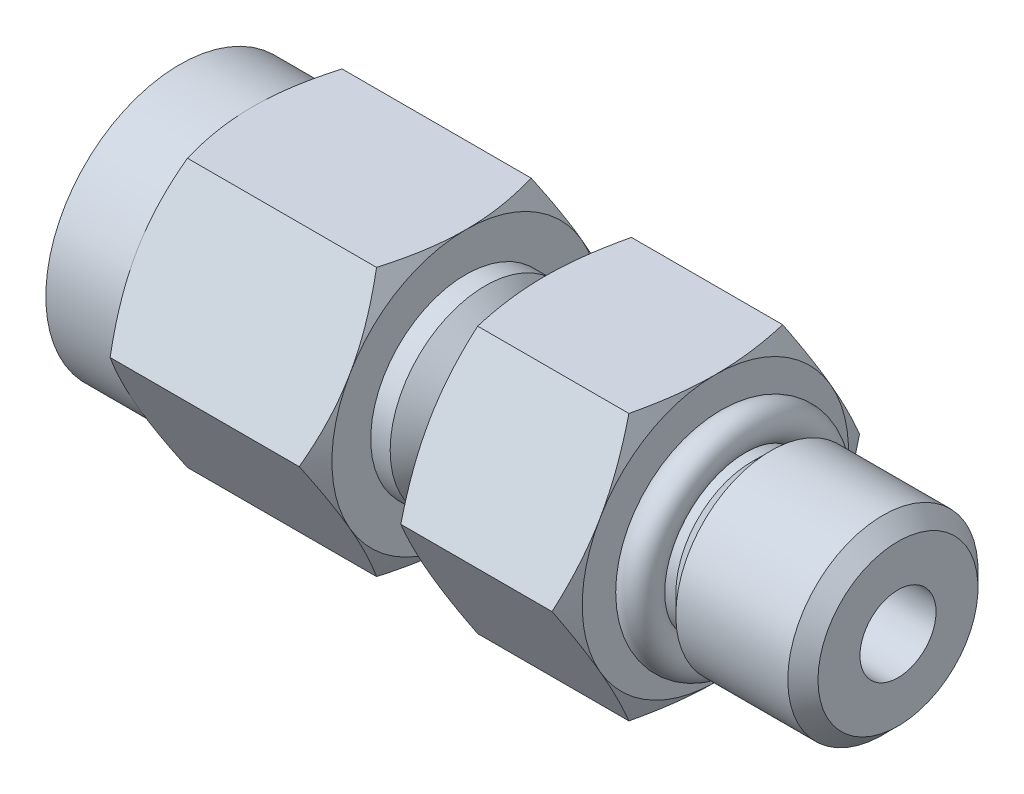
ISO-10303-21;
HEADER;
FILE_DESCRIPTION(('STEP AP214'),'2;1');
FILE_NAME('part.step','',(''),(''),'','','');
FILE_SCHEMA(('AUTOMOTIVE_DESIGN { 1 0 10303 214 1 1 1 1 }'));
ENDSEC;
DATA;
#1=APPLICATION_CONTEXT('core data for automotive mechanical design processes');
#2=APPLICATION_PROTOCOL_DEFINITION('international standard','automotive_design',2000,#1);
#3=PRODUCT_CONTEXT('',#1,'mechanical');
#4=PRODUCT('Part','Part','',(#3));
#5=PRODUCT_RELATED_PRODUCT_CATEGORY('part','',(#4));
#6=PRODUCT_DEFINITION_FORMATION('','',#4);
#7=PRODUCT_DEFINITION_CONTEXT('part definition',#1,'design');
#8=PRODUCT_DEFINITION('design','',#6,#7);
#9=PRODUCT_DEFINITION_SHAPE('','',#8);
#10=(LENGTH_UNIT() NAMED_UNIT(*) SI_UNIT(.MILLI.,.METRE.));
#11=(NAMED_UNIT(*) PLANE_ANGLE_UNIT() SI_UNIT($,.RADIAN.));
#12=(NAMED_UNIT(*) SI_UNIT($,.STERADIAN.) SOLID_ANGLE_UNIT());
#13=UNCERTAINTY_MEASURE_WITH_UNIT(LENGTH_MEASURE(1.E-05),#10,'distance_accuracy_value','');
#14=(GEOMETRIC_REPRESENTATION_CONTEXT(3) GLOBAL_UNCERTAINTY_ASSIGNED_CONTEXT((#13)) GLOBAL_UNIT_ASSIGNED_CONTEXT((#10,
#11,#12)) REPRESENTATION_CONTEXT('',''));
#15=CARTESIAN_POINT('',(0.,0.,0.));
#16=DIRECTION('',(0.,0.,1.));
#17=DIRECTION('',(1.,0.,0.));
#18=AXIS2_PLACEMENT_3D('',#15,#16,#17);
#19=CARTESIAN_POINT('',(-18.034,-5.588,3.22623330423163));
#20=DIRECTION('',(0.,-1.,0.));
#21=DIRECTION('',(0.,0.,-1.));
#22=AXIS2_PLACEMENT_3D('',#19,#20,#21);
#23=PLANE('',#22);
#24=DIRECTION('',(1.,0.,0.));
#25=VECTOR('',#24,1.);
#26=CARTESIAN_POINT('',(-18.034,-5.588,3.22623330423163));
#27=LINE('',#26,#25);
#28=CARTESIAN_POINT('',(-26.4248999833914,-5.58799996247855,3.22623332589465));
#29=VERTEX_POINT('',#28);
#30=CARTESIAN_POINT('',(-18.5331000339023,-5.588,3.22623332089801));
#31=VERTEX_POINT('',#30);
#32=EDGE_CURVE('E268',#29,#31,#27,.T.);
#33=ORIENTED_EDGE('',*,*,#32,.F.);
#34=CARTESIAN_POINT('',(-26.4248999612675,-5.588,3.22623333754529));
#35=CARTESIAN_POINT('',(-26.5007291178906,-5.588,2.96361931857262));
#36=CARTESIAN_POINT('',(-26.5702018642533,-5.588,2.69890219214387));
#37=CARTESIAN_POINT('',(-26.6927158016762,-5.588,2.16713448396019));
#38=CARTESIAN_POINT('',(-26.745838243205,-5.588,1.90010245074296));
#39=CARTESIAN_POINT('',(-26.8110635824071,-5.588,1.49703426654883));
#40=CARTESIAN_POINT('',(-26.8304035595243,-5.588,1.36216904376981));
#41=CARTESIAN_POINT('',(-26.8638814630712,-5.588,1.09179294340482));
#42=CARTESIAN_POINT('',(-26.8780195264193,-5.588,0.956282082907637));
#43=CARTESIAN_POINT('',(-26.9008451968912,-5.588,0.684113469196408));
#44=CARTESIAN_POINT('',(-26.9095050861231,-5.588,0.547453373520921));
#45=CARTESIAN_POINT('',(-26.9210944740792,-5.588,0.27386441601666));
#46=CARTESIAN_POINT('',(-26.9240228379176,-5.588,0.13693550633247));
#47=CARTESIAN_POINT('',(-26.9239999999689,-5.588,3.9348099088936E-13));
#48=B_SPLINE_CURVE_WITH_KNOTS('',3,(#34,#35,#36,#37,#38,#39,#40,#41,#42,#43,#44,#45,#46,#47),
.UNSPECIFIED.,.F.,.F.,(4,2,2,2,2,2,4),(0.,0.820359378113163,1.63657370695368,2.04521639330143,
2.45384832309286,2.86453160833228,3.2752962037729),.UNSPECIFIED.);
#49=CARTESIAN_POINT('',(-26.9239999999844,-5.588,0.));
#50=VERTEX_POINT('',#49);
#51=EDGE_CURVE('E852',#29,#50,#48,.T.);
#52=ORIENTED_EDGE('',*,*,#51,.T.);
#53=CARTESIAN_POINT('',(-26.9239999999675,-5.58799999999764,0.));
#54=CARTESIAN_POINT('',(-26.9240228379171,-5.58799999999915,-0.136935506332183));
#55=CARTESIAN_POINT('',(-26.921094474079,-5.58799999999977,-0.273864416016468));
#56=CARTESIAN_POINT('',(-26.9095050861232,-5.58800000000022,-0.547453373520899));
#57=CARTESIAN_POINT('',(-26.9008451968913,-5.58800000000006,-0.684113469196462));
#58=CARTESIAN_POINT('',(-26.8780195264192,-5.58799999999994,-0.956282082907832));
#59=CARTESIAN_POINT('',(-26.8638814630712,-5.58799999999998,-1.09179294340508));
#60=CARTESIAN_POINT('',(-26.8304035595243,-5.58800000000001,-1.3621690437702));
#61=CARTESIAN_POINT('',(-26.8110635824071,-5.588,-1.49703426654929));
#62=CARTESIAN_POINT('',(-26.7458382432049,-5.58799999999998,-1.9001024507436));
#63=CARTESIAN_POINT('',(-26.6927158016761,-5.58799999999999,-2.16713448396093));
#64=CARTESIAN_POINT('',(-26.570201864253,-5.588,-2.69890219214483));
#65=CARTESIAN_POINT('',(-26.5007291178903,-5.58800000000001,-2.96361931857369));
#66=CARTESIAN_POINT('',(-26.4248999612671,-5.588,-3.22623333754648));
#67=B_SPLINE_CURVE_WITH_KNOTS('',3,(#53,#54,#55,#56,#57,#58,#59,#60,#61,#62,#63,#64,#65,#66),
.UNSPECIFIED.,.F.,.F.,(4,2,2,2,2,2,4),(0.,0.410764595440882,0.821447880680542,1.23007981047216,
1.63872249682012,2.45493682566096,3.2752962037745),.UNSPECIFIED.);
#68=CARTESIAN_POINT('',(-26.4248999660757,-5.588,-3.22623332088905));
#69=VERTEX_POINT('',#68);
#70=EDGE_CURVE('E853',#50,#69,#67,.T.);
#71=ORIENTED_EDGE('',*,*,#70,.T.);
#72=DIRECTION('',(1.,0.,0.));
#73=VECTOR('',#72,1.);
#74=CARTESIAN_POINT('',(-18.034,-5.58799999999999,-3.22623330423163));
#75=LINE('',#74,#73);
#76=CARTESIAN_POINT('',(-18.5331000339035,-5.588000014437,-3.22623329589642));
#77=VERTEX_POINT('',#76);
#78=EDGE_CURVE('E283',#77,#69,#75,.F.);
#79=ORIENTED_EDGE('',*,*,#78,.F.);
#80=CARTESIAN_POINT('',(-18.533100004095,-5.588,-3.2262332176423));
#81=CARTESIAN_POINT('',(-18.4572708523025,-5.588,-2.96361920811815));
#82=CARTESIAN_POINT('',(-18.387798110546,-5.588,-2.69890209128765));
#83=CARTESIAN_POINT('',(-18.2652841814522,-5.588,-2.16713440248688));
#84=CARTESIAN_POINT('',(-18.2121617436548,-5.58799999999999,-1.90010237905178));
#85=CARTESIAN_POINT('',(-18.1469364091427,-5.588,-1.49703420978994));
#86=CARTESIAN_POINT('',(-18.1275964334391,-5.588,-1.36216899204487));
#87=CARTESIAN_POINT('',(-18.0941185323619,-5.588,-1.09179290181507));
#88=CARTESIAN_POINT('',(-18.0799804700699,-5.588,-0.956282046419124));
#89=CARTESIAN_POINT('',(-18.0571548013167,-5.588,-0.684113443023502));
#90=CARTESIAN_POINT('',(-18.0484949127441,-5.588,-0.547453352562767));
#91=CARTESIAN_POINT('',(-18.0369055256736,-5.588,-0.273864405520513));
#92=CARTESIAN_POINT('',(-18.0339771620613,-5.588,-0.136935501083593));
#93=CARTESIAN_POINT('',(-18.0340000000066,-5.588,0.));
#94=B_SPLINE_CURVE_WITH_KNOTS('',3,(#80,#81,#82,#83,#84,#85,#86,#87,#88,#89,#90,#91,#92,#93),
.UNSPECIFIED.,.F.,.F.,(4,2,2,2,2,2,4),(0.,0.820359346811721,1.63657364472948,2.04521631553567,
2.45384822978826,2.86453149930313,3.27529607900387),.UNSPECIFIED.);
#95=CARTESIAN_POINT('',(-18.0340000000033,-5.58799999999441,0.));
#96=VERTEX_POINT('',#95);
#97=EDGE_CURVE('E803',#77,#96,#94,.T.);
#98=ORIENTED_EDGE('',*,*,#97,.T.);
#99=CARTESIAN_POINT('',(-18.0340000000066,-5.588,0.));
#100=CARTESIAN_POINT('',(-18.0339771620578,-5.588,0.136935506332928));
#101=CARTESIAN_POINT('',(-18.0369055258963,-5.588,0.273864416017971));
#102=CARTESIAN_POINT('',(-18.0484949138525,-5.588,0.547453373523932));
#103=CARTESIAN_POINT('',(-18.0571548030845,-5.588,0.684113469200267));
#104=CARTESIAN_POINT('',(-18.0799804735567,-5.588,0.956282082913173));
#105=CARTESIAN_POINT('',(-18.0941185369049,-5.588,1.09179294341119));
#106=CARTESIAN_POINT('',(-18.1275964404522,-5.588,1.36216904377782));
#107=CARTESIAN_POINT('',(-18.1469364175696,-5.588,1.49703426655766));
#108=CARTESIAN_POINT('',(-18.2121617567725,-5.588,1.90010245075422));
#109=CARTESIAN_POINT('',(-18.2652841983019,-5.588,2.16713448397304));
#110=CARTESIAN_POINT('',(-18.3877981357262,-5.588,2.69890219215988));
#111=CARTESIAN_POINT('',(-18.4572708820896,-5.588,2.96361931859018));
#112=CARTESIAN_POINT('',(-18.5331000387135,-5.588,3.22623333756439));
#113=B_SPLINE_CURVE_WITH_KNOTS('',3,(#99,#100,#101,#102,#103,#104,#105,#106,#107,#108,#109,#110,
#111,#112),.UNSPECIFIED.,.F.,.F.,(4,2,2,2,2,2,4),(0.,0.410764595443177,0.82144788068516,
1.23007981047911,1.63872249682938,2.45493682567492,3.27529620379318),.UNSPECIFIED.);
#114=EDGE_CURVE('E810',#96,#31,#113,.T.);
#115=ORIENTED_EDGE('',*,*,#114,.T.);
#116=EDGE_LOOP('',(#33,#52,#71,#79,#98,#115));
#117=FACE_BOUND('',#116,.T.);
#118=ADVANCED_FACE('F44',(#117),#23,.T.);
#119=CARTESIAN_POINT('',(-18.034,0.,6.45246660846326));
#120=DIRECTION('',(0.,-0.5,0.866025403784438));
#121=DIRECTION('',(0.,-0.866025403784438,-0.5));
#122=AXIS2_PLACEMENT_3D('',#119,#120,#121);
#123=PLANE('',#122);
#124=CARTESIAN_POINT('',(-18.0340000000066,-2.794,4.83934995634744));
#125=CARTESIAN_POINT('',(-18.0339771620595,-2.67541037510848,4.90781770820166));
#126=CARTESIAN_POINT('',(-18.036905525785,-2.55682646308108,4.97628216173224));
#127=CARTESIAN_POINT('',(-18.0484949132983,-2.31989148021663,5.11307663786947));
#128=CARTESIAN_POINT('',(-18.0571548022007,-2.20154036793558,5.18140668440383));
#129=CARTESIAN_POINT('',(-18.0799804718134,-1.96583543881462,5.31749098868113));
#130=CARTESIAN_POINT('',(-18.0941185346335,-1.84847959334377,5.38524641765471));
#131=CARTESIAN_POINT('',(-18.1275964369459,-1.61432702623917,5.52043446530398));
#132=CARTESIAN_POINT('',(-18.1469364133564,-1.49753031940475,5.5878670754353));
#133=CARTESIAN_POINT('',(-18.2121617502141,-1.14846303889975,5.78940116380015));
#134=CARTESIAN_POINT('',(-18.2652841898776,-0.917206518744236,5.9229171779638));
#135=CARTESIAN_POINT('',(-18.3877981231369,-0.456682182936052,6.18880102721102));
#136=CARTESIAN_POINT('',(-18.4572708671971,-0.227430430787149,6.32115958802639));
#137=CARTESIAN_POINT('',(-18.5331000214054,-2.30572761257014E-08,6.45246659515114));
#138=B_SPLINE_CURVE_WITH_KNOTS('',3,(#124,#125,#126,#127,#128,#129,#130,#131,#132,#133,#134,
#135,#136,#137),.UNSPECIFIED.,.F.,.F.,(4,2,2,2,2,2,4),(0.,0.41076458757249,0.821447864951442,
1.23007978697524,1.63872246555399,2.45493677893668,3.27529614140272),.UNSPECIFIED.);
#139=CARTESIAN_POINT('',(-18.0340000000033,-2.79399999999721,4.8393499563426));
#140=VERTEX_POINT('',#139);
#141=CARTESIAN_POINT('',(-18.5331000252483,-1.15286399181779E-08,6.4524666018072));
#142=VERTEX_POINT('',#141);
#143=EDGE_CURVE('E271',#140,#142,#138,.T.);
#144=ORIENTED_EDGE('',*,*,#143,.T.);
#145=DIRECTION('',(1.,0.,0.));
#146=VECTOR('',#145,1.);
#147=CARTESIAN_POINT('',(-18.034,0.,6.45246660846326));
#148=LINE('',#147,#146);
#149=CARTESIAN_POINT('',(-26.4248999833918,3.75225243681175E-08,6.45246658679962));
#150=VERTEX_POINT('',#149);
#151=EDGE_CURVE('E256',#150,#142,#148,.T.);
#152=ORIENTED_EDGE('',*,*,#151,.F.);
#153=CARTESIAN_POINT('',(-26.4248999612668,2.88526283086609E-08,6.45246662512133));
#154=CARTESIAN_POINT('',(-26.50072911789,-0.227430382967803,6.3211596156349));
#155=CARTESIAN_POINT('',(-26.5702018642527,-0.456682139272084,6.18880105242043));
#156=CARTESIAN_POINT('',(-26.6927158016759,-0.917206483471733,5.92291719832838));
#157=CARTESIAN_POINT('',(-26.7458382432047,-1.14846300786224,5.78940118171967));
#158=CARTESIAN_POINT('',(-26.811063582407,-1.49753029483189,5.58786708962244));
#159=CARTESIAN_POINT('',(-26.8304035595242,-1.61432700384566,5.52043447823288));
#160=CARTESIAN_POINT('',(-26.8638814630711,-1.84847957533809,5.38524642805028));
#161=CARTESIAN_POINT('',(-26.8780195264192,-1.96583542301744,5.31749099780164));
#162=CARTESIAN_POINT('',(-26.9008451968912,-2.20154035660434,5.18140669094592));
#163=CARTESIAN_POINT('',(-26.9095050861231,-2.31989147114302,5.11307664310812));
#164=CARTESIAN_POINT('',(-26.9210944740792,-2.5568264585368,4.97628216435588));
#165=CARTESIAN_POINT('',(-26.9240228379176,-2.6754103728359,4.90781770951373));
#166=CARTESIAN_POINT('',(-26.9239999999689,-2.79399999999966,4.83934995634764));
#167=B_SPLINE_CURVE_WITH_KNOTS('',3,(#153,#154,#155,#156,#157,#158,#159,#160,#161,#162,#163,
#164,#165,#166),.UNSPECIFIED.,.F.,.F.,(4,2,2,2,2,2,4),(0.,0.820359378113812,1.63657370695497,
2.04521639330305,2.45384832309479,2.86453160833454,3.27529620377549),.UNSPECIFIED.);
#168=CARTESIAN_POINT('',(-26.9239999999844,-2.794,4.83934995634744));
#169=VERTEX_POINT('',#168);
#170=EDGE_CURVE('E834',#150,#169,#167,.T.);
#171=ORIENTED_EDGE('',*,*,#170,.T.);
#172=CARTESIAN_POINT('',(-26.9239999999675,-2.79399999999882,4.8393499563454));
#173=CARTESIAN_POINT('',(-26.9240228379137,-2.91258962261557,4.77088220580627));
#174=CARTESIAN_POINT('',(-26.9210944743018,-3.03117353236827,4.7024177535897));
#175=CARTESIAN_POINT('',(-26.9095050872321,-3.26810851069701,4.56562328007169));
#176=CARTESIAN_POINT('',(-26.9008451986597,-3.38645962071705,4.49729323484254));
#177=CARTESIAN_POINT('',(-26.8780195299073,-3.62216454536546,4.36120893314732));
#178=CARTESIAN_POINT('',(-26.863881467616,-3.73952038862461,4.29345350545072));
#179=CARTESIAN_POINT('',(-26.83040356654,-3.97367295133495,4.1582654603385));
#180=CARTESIAN_POINT('',(-26.8110635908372,-4.09046965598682,4.09083285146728));
#181=CARTESIAN_POINT('',(-26.7458382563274,-4.43953693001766,3.88929876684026));
#182=CARTESIAN_POINT('',(-26.6927158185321,-4.67079344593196,3.75578275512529));
#183=CARTESIAN_POINT('',(-26.5702018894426,-5.13131777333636,3.48989891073));
#184=CARTESIAN_POINT('',(-26.5007291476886,-5.36056952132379,3.35754035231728));
#185=CARTESIAN_POINT('',(-26.4248999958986,-5.58799992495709,3.22623334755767));
#186=B_SPLINE_CURVE_WITH_KNOTS('',3,(#172,#173,#174,#175,#176,#177,#178,#179,#180,#181,#182,
#183,#184,#185),.UNSPECIFIED.,.F.,.F.,(4,2,2,2,2,2,4),(0.,0.410764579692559,0.821447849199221,
1.23007976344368,1.63872243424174,2.45493673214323,3.27529607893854),.UNSPECIFIED.);
#187=EDGE_CURVE('E843',#169,#29,#186,.T.);
#188=ORIENTED_EDGE('',*,*,#187,.T.);
#189=ORIENTED_EDGE('',*,*,#32,.T.);
#190=CARTESIAN_POINT('',(-18.5331000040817,-5.58799992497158,3.2262333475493));
#191=CARTESIAN_POINT('',(-18.4572708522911,-5.36056952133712,3.35754035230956));
#192=CARTESIAN_POINT('',(-18.3877981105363,-5.13131777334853,3.48989891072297));
#193=CARTESIAN_POINT('',(-18.2652841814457,-4.67079344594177,3.75578275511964));
#194=CARTESIAN_POINT('',(-18.2121617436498,-4.43953693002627,3.88929876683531));
#195=CARTESIAN_POINT('',(-18.1469364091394,-4.09046965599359,4.09083285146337));
#196=CARTESIAN_POINT('',(-18.1275964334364,-3.97367295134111,4.15826546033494));
#197=CARTESIAN_POINT('',(-18.0941185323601,-3.73952038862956,4.29345350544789));
#198=CARTESIAN_POINT('',(-18.0799804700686,-3.6221645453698,4.36120893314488));
#199=CARTESIAN_POINT('',(-18.057154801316,-3.38645962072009,4.49729323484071));
#200=CARTESIAN_POINT('',(-18.0484949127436,-3.26810851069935,4.56562328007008));
#201=CARTESIAN_POINT('',(-18.0369055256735,-3.0311735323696,4.7024177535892));
#202=CARTESIAN_POINT('',(-18.0339771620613,-2.9125896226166,4.77088220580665));
#203=CARTESIAN_POINT('',(-18.0340000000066,-2.794,4.83934995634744));
#204=B_SPLINE_CURVE_WITH_KNOTS('',3,(#190,#191,#192,#193,#194,#195,#196,#197,#198,#199,#200,
#201,#202,#203),.UNSPECIFIED.,.F.,.F.,(4,2,2,2,2,2,4),(0.,0.820359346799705,1.63657364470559,
2.04521631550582,2.45384822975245,2.86453149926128,3.27529607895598),.UNSPECIFIED.);
#205=EDGE_CURVE('E274',#31,#140,#204,.T.);
#206=ORIENTED_EDGE('',*,*,#205,.T.);
#207=EDGE_LOOP('',(#144,#152,#171,#188,#189,#206));
#208=FACE_BOUND('',#207,.T.);
#209=ADVANCED_FACE('F272',(#208),#123,.T.);
#210=CARTESIAN_POINT('',(-18.034,5.588,3.22623330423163));
#211=DIRECTION('',(0.,0.5,0.866025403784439));
#212=DIRECTION('',(0.,-0.866025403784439,0.5));
#213=AXIS2_PLACEMENT_3D('',#210,#211,#212);
#214=PLANE('',#213);
#215=DIRECTION('',(1.,0.,0.));
#216=VECTOR('',#215,1.);
#217=CARTESIAN_POINT('',(-18.034,5.588,3.22623330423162));
#218=LINE('',#217,#216);
#219=CARTESIAN_POINT('',(-26.4248999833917,5.588,3.22623326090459));
#220=VERTEX_POINT('',#219);
#221=CARTESIAN_POINT('',(-18.5331000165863,5.58799996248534,3.22623332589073));
#222=VERTEX_POINT('',#221);
#223=EDGE_CURVE('E267',#220,#222,#218,.T.);
#224=ORIENTED_EDGE('',*,*,#223,.F.);
#225=CARTESIAN_POINT('',(-26.4248999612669,5.58800002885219,3.22623328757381));
#226=CARTESIAN_POINT('',(-26.5007291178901,5.3605696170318,3.35754029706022));
#227=CARTESIAN_POINT('',(-26.5702018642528,5.13131786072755,3.48989886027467));
#228=CARTESIAN_POINT('',(-26.6927158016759,4.67079351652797,3.75578271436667));
#229=CARTESIAN_POINT('',(-26.7458382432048,4.4395369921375,3.88929873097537));
#230=CARTESIAN_POINT('',(-26.811063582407,4.0904697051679,4.09083282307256));
#231=CARTESIAN_POINT('',(-26.8304035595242,3.97367299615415,4.15826543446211));
#232=CARTESIAN_POINT('',(-26.8638814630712,3.73952042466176,4.29345348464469));
#233=CARTESIAN_POINT('',(-26.8780195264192,3.62216457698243,4.36120891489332));
#234=CARTESIAN_POINT('',(-26.9008451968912,3.38645964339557,4.49729322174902));
#235=CARTESIAN_POINT('',(-26.9095050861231,3.26810852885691,4.56562326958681));
#236=CARTESIAN_POINT('',(-26.9210944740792,3.03117354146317,4.70241774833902));
#237=CARTESIAN_POINT('',(-26.9240228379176,2.91258962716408,4.77088220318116));
#238=CARTESIAN_POINT('',(-26.9239999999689,2.79400000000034,4.83934995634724));
#239=B_SPLINE_CURVE_WITH_KNOTS('',3,(#225,#226,#227,#228,#229,#230,#231,#232,#233,#234,#235,
#236,#237,#238),.UNSPECIFIED.,.F.,.F.,(4,2,2,2,2,2,4),(0.,0.820359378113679,1.63657370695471,
2.04521639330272,2.4538483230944,2.86453160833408,3.27529620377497),.UNSPECIFIED.);
#240=CARTESIAN_POINT('',(-26.9239999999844,2.794,4.83934995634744));
#241=VERTEX_POINT('',#240);
#242=EDGE_CURVE('E1577',#220,#241,#239,.T.);
#243=ORIENTED_EDGE('',*,*,#242,.T.);
#244=CARTESIAN_POINT('',(-26.9239999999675,2.79399999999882,4.8393499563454));
#245=CARTESIAN_POINT('',(-26.9240228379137,2.67541037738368,4.90781770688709));
#246=CARTESIAN_POINT('',(-26.9210944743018,2.55682646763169,4.97628215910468));
#247=CARTESIAN_POINT('',(-26.9095050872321,2.31989148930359,5.11307663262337));
#248=CARTESIAN_POINT('',(-26.9008451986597,2.20154037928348,5.18140667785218));
#249=CARTESIAN_POINT('',(-26.8780195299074,1.96583545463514,5.31749097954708));
#250=CARTESIAN_POINT('',(-26.863881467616,1.84847961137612,5.3852464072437));
#251=CARTESIAN_POINT('',(-26.8304035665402,1.61432704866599,5.52043445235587));
#252=CARTESIAN_POINT('',(-26.8110635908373,1.4975303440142,5.58786706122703));
#253=CARTESIAN_POINT('',(-26.7458382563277,1.14846306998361,5.78940114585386));
#254=CARTESIAN_POINT('',(-26.6927158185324,0.917206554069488,5.92291715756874));
#255=CARTESIAN_POINT('',(-26.5702018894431,0.456682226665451,6.18880100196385));
#256=CARTESIAN_POINT('',(-26.5007291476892,0.2274304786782,6.32115956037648));
#257=CARTESIAN_POINT('',(-26.4248999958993,7.50450545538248E-08,6.45246656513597));
#258=B_SPLINE_CURVE_WITH_KNOTS('',3,(#244,#245,#246,#247,#248,#249,#250,#251,#252,#253,#254,
#255,#256,#257),.UNSPECIFIED.,.F.,.F.,(4,2,2,2,2,2,4),(0.,0.410764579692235,0.82144784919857,
1.23007976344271,1.63872243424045,2.4549367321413,3.27529607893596),.UNSPECIFIED.);
#259=EDGE_CURVE('E262',#241,#150,#258,.T.);
#260=ORIENTED_EDGE('',*,*,#259,.T.);
#261=ORIENTED_EDGE('',*,*,#151,.T.);
#262=CARTESIAN_POINT('',(-18.5331000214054,2.30572721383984E-08,6.45246659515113));
#263=CARTESIAN_POINT('',(-18.4572708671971,0.227430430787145,6.32115958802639));
#264=CARTESIAN_POINT('',(-18.3877981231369,0.456682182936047,6.18880102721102));
#265=CARTESIAN_POINT('',(-18.2652841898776,0.917206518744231,5.9229171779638));
#266=CARTESIAN_POINT('',(-18.2121617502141,1.14846303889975,5.78940116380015));
#267=CARTESIAN_POINT('',(-18.1469364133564,1.49753031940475,5.5878670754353));
#268=CARTESIAN_POINT('',(-18.1275964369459,1.61432702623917,5.52043446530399));
#269=CARTESIAN_POINT('',(-18.0941185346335,1.84847959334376,5.38524641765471));
#270=CARTESIAN_POINT('',(-18.0799804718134,1.96583543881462,5.31749098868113));
#271=CARTESIAN_POINT('',(-18.0571548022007,2.20154036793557,5.18140668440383));
#272=CARTESIAN_POINT('',(-18.0484949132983,2.31989148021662,5.11307663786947));
#273=CARTESIAN_POINT('',(-18.036905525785,2.55682646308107,4.97628216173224));
#274=CARTESIAN_POINT('',(-18.0339771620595,2.67541037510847,4.90781770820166));
#275=CARTESIAN_POINT('',(-18.0340000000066,2.794,4.83934995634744));
#276=B_SPLINE_CURVE_WITH_KNOTS('',3,(#262,#263,#264,#265,#266,#267,#268,#269,#270,#271,#272,
#273,#274,#275),.UNSPECIFIED.,.F.,.F.,(4,2,2,2,2,2,4),(0.,0.820359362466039,1.63657367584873,
2.04521635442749,2.45384827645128,2.86453155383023,3.27529614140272),.UNSPECIFIED.);
#277=CARTESIAN_POINT('',(-18.0340000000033,2.79399999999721,4.8393499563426));
#278=VERTEX_POINT('',#277);
#279=EDGE_CURVE('E48',#142,#278,#276,.T.);
#280=ORIENTED_EDGE('',*,*,#279,.T.);
#281=CARTESIAN_POINT('',(-18.0340000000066,2.794,4.83934995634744));
#282=CARTESIAN_POINT('',(-18.0339771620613,2.91258962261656,4.77088220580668));
#283=CARTESIAN_POINT('',(-18.0369055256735,3.03117353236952,4.70241775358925));
#284=CARTESIAN_POINT('',(-18.0484949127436,3.26810851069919,4.56562328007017));
#285=CARTESIAN_POINT('',(-18.057154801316,3.38645962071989,4.49729323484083));
#286=CARTESIAN_POINT('',(-18.0799804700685,3.62216454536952,4.36120893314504));
#287=CARTESIAN_POINT('',(-18.0941185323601,3.73952038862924,4.29345350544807));
#288=CARTESIAN_POINT('',(-18.1275964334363,3.97367295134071,4.15826546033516));
#289=CARTESIAN_POINT('',(-18.1469364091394,4.09046965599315,4.09083285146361));
#290=CARTESIAN_POINT('',(-18.2121617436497,4.43953693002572,3.88929876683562));
#291=CARTESIAN_POINT('',(-18.2652841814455,4.67079344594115,3.75578275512));
#292=CARTESIAN_POINT('',(-18.3877981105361,5.13131777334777,3.48989891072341));
#293=CARTESIAN_POINT('',(-18.4572708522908,5.36056952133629,3.35754035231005));
#294=CARTESIAN_POINT('',(-18.5331000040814,5.58799992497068,3.22623334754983));
#295=B_SPLINE_CURVE_WITH_KNOTS('',3,(#281,#282,#283,#284,#285,#286,#287,#288,#289,#290,#291,
#292,#293,#294),.UNSPECIFIED.,.F.,.F.,(4,2,2,2,2,2,4),(0.,0.410764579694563,0.821447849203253,
1.23007976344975,1.63872243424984,2.45493673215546,3.27529607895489),.UNSPECIFIED.);
#296=EDGE_CURVE('E886',#278,#222,#295,.T.);
#297=ORIENTED_EDGE('',*,*,#296,.T.);
#298=EDGE_LOOP('',(#224,#243,#260,#261,#280,#297));
#299=FACE_BOUND('',#298,.T.);
#300=ADVANCED_FACE('F258',(#299),#214,.T.);
#301=CARTESIAN_POINT('',(-18.034,5.588,0.));
#302=DIRECTION('',(0.,1.,0.));
#303=DIRECTION('',(0.,0.,1.));
#304=AXIS2_PLACEMENT_3D('',#301,#302,#303);
#305=PLANE('',#304);
#306=DIRECTION('',(1.,0.,0.));
#307=VECTOR('',#306,1.);
#308=CARTESIAN_POINT('',(-18.034,5.588,-3.22623330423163));
#309=LINE('',#308,#307);
#310=CARTESIAN_POINT('',(-26.4248999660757,5.58800001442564,-3.22623329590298));
#311=VERTEX_POINT('',#310);
#312=CARTESIAN_POINT('',(-18.5331000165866,5.588,-3.22623326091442));
#313=VERTEX_POINT('',#312);
#314=EDGE_CURVE('E298',#311,#313,#309,.T.);
#315=ORIENTED_EDGE('',*,*,#314,.F.);
#316=CARTESIAN_POINT('',(-26.4248999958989,5.588,-3.22623321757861));
#317=CARTESIAN_POINT('',(-26.5007291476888,5.588,-2.96361920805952));
#318=CARTESIAN_POINT('',(-26.5702018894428,5.588,-2.69890209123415));
#319=CARTESIAN_POINT('',(-26.6927158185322,5.588,-2.16713440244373));
#320=CARTESIAN_POINT('',(-26.7458382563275,5.588,-1.90010237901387));
#321=CARTESIAN_POINT('',(-26.8110635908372,5.588,-1.49703420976));
#322=CARTESIAN_POINT('',(-26.83040356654,5.588,-1.36216899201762));
#323=CARTESIAN_POINT('',(-26.863881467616,5.588,-1.09179290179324));
#324=CARTESIAN_POINT('',(-26.8780195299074,5.588,-0.956282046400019));
#325=CARTESIAN_POINT('',(-26.9008451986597,5.588,-0.68411344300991));
#326=CARTESIAN_POINT('',(-26.909505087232,5.588,-0.547453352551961));
#327=CARTESIAN_POINT('',(-26.921094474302,5.588,-0.273864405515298));
#328=CARTESIAN_POINT('',(-26.9240228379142,5.588,-0.13693550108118));
#329=CARTESIAN_POINT('',(-26.9239999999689,5.588,-3.93609674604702E-13));
#330=B_SPLINE_CURVE_WITH_KNOTS('',3,(#316,#317,#318,#319,#320,#321,#322,#323,#324,#325,#326,
#327,#328,#329),.UNSPECIFIED.,.F.,.F.,(4,2,2,2,2,2,4),(0.,0.820359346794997,1.63657364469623,
2.04521631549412,2.45384822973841,2.86453149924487,3.27529607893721),.UNSPECIFIED.);
#331=CARTESIAN_POINT('',(-26.9239999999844,5.588,0.));
#332=VERTEX_POINT('',#331);
#333=EDGE_CURVE('E1568',#311,#332,#330,.T.);
#334=ORIENTED_EDGE('',*,*,#333,.T.);
#335=CARTESIAN_POINT('',(-26.9239999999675,5.58799999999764,0.));
#336=CARTESIAN_POINT('',(-26.9240228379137,5.58799999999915,0.136935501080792));
#337=CARTESIAN_POINT('',(-26.9210944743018,5.58799999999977,0.273864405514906));
#338=CARTESIAN_POINT('',(-26.9095050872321,5.58800000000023,0.547453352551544));
#339=CARTESIAN_POINT('',(-26.9008451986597,5.58800000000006,0.684113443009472));
#340=CARTESIAN_POINT('',(-26.8780195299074,5.58799999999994,0.95628204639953));
#341=CARTESIAN_POINT('',(-26.863881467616,5.58799999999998,1.09179290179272));
#342=CARTESIAN_POINT('',(-26.8304035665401,5.58800000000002,1.36216899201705));
#343=CARTESIAN_POINT('',(-26.8110635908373,5.58800000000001,1.4970342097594));
#344=CARTESIAN_POINT('',(-26.7458382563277,5.58799999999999,1.90010237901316));
#345=CARTESIAN_POINT('',(-26.6927158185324,5.58799999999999,2.16713440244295));
#346=CARTESIAN_POINT('',(-26.570201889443,5.58800000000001,2.69890209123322));
#347=CARTESIAN_POINT('',(-26.5007291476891,5.58800000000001,2.96361920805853));
#348=CARTESIAN_POINT('',(-26.4248999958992,5.588,3.22623321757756));
#349=B_SPLINE_CURVE_WITH_KNOTS('',3,(#335,#336,#337,#338,#339,#340,#341,#342,#343,#344,#345,
#346,#347,#348),.UNSPECIFIED.,.F.,.F.,(4,2,2,2,2,2,4),(0.,0.4107645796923,0.821447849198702,
1.2300797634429,1.63872243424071,2.45493673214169,3.27529607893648),.UNSPECIFIED.);
#350=EDGE_CURVE('E1573',#332,#220,#349,.T.);
#351=ORIENTED_EDGE('',*,*,#350,.T.);
#352=ORIENTED_EDGE('',*,*,#223,.T.);
#353=CARTESIAN_POINT('',(-18.5331000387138,5.588,3.22623333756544));
#354=CARTESIAN_POINT('',(-18.4572708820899,5.588,2.96361931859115));
#355=CARTESIAN_POINT('',(-18.3877981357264,5.588,2.69890219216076));
#356=CARTESIAN_POINT('',(-18.265284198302,5.588,2.16713448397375));
#357=CARTESIAN_POINT('',(-18.2121617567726,5.588,1.90010245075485));
#358=CARTESIAN_POINT('',(-18.1469364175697,5.588,1.49703426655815));
#359=CARTESIAN_POINT('',(-18.1275964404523,5.588,1.36216904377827));
#360=CARTESIAN_POINT('',(-18.0941185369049,5.588,1.09179294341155));
#361=CARTESIAN_POINT('',(-18.0799804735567,5.588,0.956282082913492));
#362=CARTESIAN_POINT('',(-18.0571548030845,5.588,0.684113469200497));
#363=CARTESIAN_POINT('',(-18.0484949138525,5.588,0.547453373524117));
#364=CARTESIAN_POINT('',(-18.0369055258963,5.588,0.273864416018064));
#365=CARTESIAN_POINT('',(-18.0339771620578,5.588,0.136935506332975));
#366=CARTESIAN_POINT('',(-18.0340000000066,5.588,0.));
#367=B_SPLINE_CURVE_WITH_KNOTS('',3,(#353,#354,#355,#356,#357,#358,#359,#360,#361,#362,#363,
#364,#365,#366),.UNSPECIFIED.,.F.,.F.,(4,2,2,2,2,2,4),(0.,0.820359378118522,1.63657370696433,
2.04521639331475,2.45384832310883,2.86453160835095,3.27529620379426),.UNSPECIFIED.);
#368=CARTESIAN_POINT('',(-18.0340000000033,5.58799999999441,0.));
#369=VERTEX_POINT('',#368);
#370=EDGE_CURVE('E880',#222,#369,#367,.T.);
#371=ORIENTED_EDGE('',*,*,#370,.T.);
#372=CARTESIAN_POINT('',(-18.0340000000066,5.588,0.));
#373=CARTESIAN_POINT('',(-18.0339771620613,5.588,-0.136935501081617));
#374=CARTESIAN_POINT('',(-18.0369055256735,5.588,-0.273864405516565));
#375=CARTESIAN_POINT('',(-18.0484949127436,5.588,-0.547453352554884));
#376=CARTESIAN_POINT('',(-18.057154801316,5.588,-0.684113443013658));
#377=CARTESIAN_POINT('',(-18.0799804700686,5.588,-0.9562820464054));
#378=CARTESIAN_POINT('',(-18.0941185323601,5.588,-1.09179290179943));
#379=CARTESIAN_POINT('',(-18.1275964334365,5.588,-1.36216899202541));
#380=CARTESIAN_POINT('',(-18.1469364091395,5.588,-1.49703420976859));
#381=CARTESIAN_POINT('',(-18.2121617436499,5.588,-1.90010237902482));
#382=CARTESIAN_POINT('',(-18.2652841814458,5.588,-2.16713440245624));
#383=CARTESIAN_POINT('',(-18.3877981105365,5.588,-2.69890209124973));
#384=CARTESIAN_POINT('',(-18.4572708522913,5.588,-2.96361920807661));
#385=CARTESIAN_POINT('',(-18.533100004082,5.588,-3.22623321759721));
#386=B_SPLINE_CURVE_WITH_KNOTS('',3,(#372,#373,#374,#375,#376,#377,#378,#379,#380,#381,#382,
#383,#384,#385),.UNSPECIFIED.,.F.,.F.,(4,2,2,2,2,2,4),(0.,0.410764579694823,0.821447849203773,
1.23007976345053,1.63872243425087,2.454936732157,3.27529607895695),.UNSPECIFIED.);
#387=EDGE_CURVE('E769',#369,#313,#386,.T.);
#388=ORIENTED_EDGE('',*,*,#387,.T.);
#389=EDGE_LOOP('',(#315,#334,#351,#352,#371,#388));
#390=FACE_BOUND('',#389,.T.);
#391=ADVANCED_FACE('F905',(#390),#305,.T.);
#392=CARTESIAN_POINT('',(-18.034,0.,-6.45246660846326));
#393=DIRECTION('',(0.,0.5,-0.866025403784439));
#394=DIRECTION('',(0.,0.866025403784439,0.5));
#395=AXIS2_PLACEMENT_3D('',#392,#393,#394);
#396=PLANE('',#395);
#397=CARTESIAN_POINT('',(-18.0340000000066,2.794,-4.83934995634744));
#398=CARTESIAN_POINT('',(-18.0339771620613,2.67541037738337,-4.90781770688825));
#399=CARTESIAN_POINT('',(-18.0369055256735,2.55682646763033,-4.97628215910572));
#400=CARTESIAN_POINT('',(-18.0484949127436,2.31989148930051,-5.11307663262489));
#401=CARTESIAN_POINT('',(-18.057154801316,2.20154037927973,-5.18140667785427));
#402=CARTESIAN_POINT('',(-18.0799804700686,1.96583545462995,-5.31749097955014));
#403=CARTESIAN_POINT('',(-18.0941185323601,1.84847961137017,-5.38524640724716));
#404=CARTESIAN_POINT('',(-18.1275964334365,1.61432704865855,-5.52043445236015));
#405=CARTESIAN_POINT('',(-18.1469364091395,1.49753034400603,-5.58786706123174));
#406=CARTESIAN_POINT('',(-18.2121617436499,1.14846306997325,-5.78940114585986));
#407=CARTESIAN_POINT('',(-18.2652841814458,0.917206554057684,-5.92291715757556));
#408=CARTESIAN_POINT('',(-18.3877981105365,0.456682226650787,-6.18880100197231));
#409=CARTESIAN_POINT('',(-18.4572708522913,0.227430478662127,-6.32115956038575));
#410=CARTESIAN_POINT('',(-18.5331000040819,7.50276035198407E-08,-6.45246656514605));
#411=B_SPLINE_CURVE_WITH_KNOTS('',3,(#397,#398,#399,#400,#401,#402,#403,#404,#405,#406,#407,
#408,#409,#410),.UNSPECIFIED.,.F.,.F.,(4,2,2,2,2,2,4),(0.,0.410764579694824,0.821447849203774,
1.23007976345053,1.63872243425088,2.454936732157,3.27529607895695),.UNSPECIFIED.);
#412=CARTESIAN_POINT('',(-18.0340000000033,2.79399999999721,-4.8393499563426));
#413=VERTEX_POINT('',#412);
#414=CARTESIAN_POINT('',(-18.5331000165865,3.75138015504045E-08,-6.45246658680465));
#415=VERTEX_POINT('',#414);
#416=EDGE_CURVE('E770',#413,#415,#411,.T.);
#417=ORIENTED_EDGE('',*,*,#416,.T.);
#418=DIRECTION('',(1.,0.,0.));
#419=VECTOR('',#418,1.);
#420=CARTESIAN_POINT('',(-18.034,0.,-6.45246660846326));
#421=LINE('',#420,#419);
#422=CARTESIAN_POINT('',(-26.4248999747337,-1.15481059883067E-08,-6.45246660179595));
#423=VERTEX_POINT('',#422);
#424=EDGE_CURVE('E287',#423,#415,#421,.T.);
#425=ORIENTED_EDGE('',*,*,#424,.F.);
#426=CARTESIAN_POINT('',(-26.424899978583,2.30962125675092E-08,-6.45246659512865));
#427=CARTESIAN_POINT('',(-26.5007291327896,0.227430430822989,-6.32115958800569));
#428=CARTESIAN_POINT('',(-26.5702018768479,0.456682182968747,-6.18880102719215));
#429=CARTESIAN_POINT('',(-26.6927158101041,0.917206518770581,-5.92291717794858));
#430=CARTESIAN_POINT('',(-26.7458382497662,1.14846303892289,-5.78940116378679));
#431=CARTESIAN_POINT('',(-26.8110635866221,1.497530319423,-5.58786707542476));
#432=CARTESIAN_POINT('',(-26.8304035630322,1.61432702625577,-5.5204344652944));
#433=CARTESIAN_POINT('',(-26.8638814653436,1.84847959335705,-5.38524641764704));
#434=CARTESIAN_POINT('',(-26.8780195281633,1.96583543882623,-5.31749098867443));
#435=CARTESIAN_POINT('',(-26.9008451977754,2.20154036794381,-5.18140668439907));
#436=CARTESIAN_POINT('',(-26.9095050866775,2.31989148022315,-5.1130766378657));
#437=CARTESIAN_POINT('',(-26.9210944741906,2.55682646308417,-4.97628216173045));
#438=CARTESIAN_POINT('',(-26.9240228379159,2.67541037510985,-4.90781770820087));
#439=CARTESIAN_POINT('',(-26.9239999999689,2.79399999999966,-4.83934995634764));
#440=B_SPLINE_CURVE_WITH_KNOTS('',3,(#426,#427,#428,#429,#430,#431,#432,#433,#434,#435,#436,
#437,#438,#439),.UNSPECIFIED.,.F.,.F.,(4,2,2,2,2,2,4),(0.,0.820359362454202,1.6365736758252,
2.04521635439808,2.453848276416,2.86453155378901,3.27529614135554),.UNSPECIFIED.);
#441=CARTESIAN_POINT('',(-26.9239999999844,2.794,-4.83934995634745));
#442=VERTEX_POINT('',#441);
#443=EDGE_CURVE('E727',#423,#442,#440,.T.);
#444=ORIENTED_EDGE('',*,*,#443,.T.);
#445=CARTESIAN_POINT('',(-26.9239999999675,2.79399999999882,-4.8393499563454));
#446=CARTESIAN_POINT('',(-26.9240228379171,2.91258962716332,-4.77088220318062));
#447=CARTESIAN_POINT('',(-26.921094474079,3.03117354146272,-4.70241774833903));
#448=CARTESIAN_POINT('',(-26.9095050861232,3.26810852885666,-4.56562326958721));
#449=CARTESIAN_POINT('',(-26.9008451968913,3.38645964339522,-4.49729322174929));
#450=CARTESIAN_POINT('',(-26.8780195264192,3.62216457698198,-4.36120891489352));
#451=CARTESIAN_POINT('',(-26.8638814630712,3.7395204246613,-4.29345348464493));
#452=CARTESIAN_POINT('',(-26.8304035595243,3.97367299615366,-4.15826543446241));
#453=CARTESIAN_POINT('',(-26.8110635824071,4.09046970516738,-4.09083282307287));
#454=CARTESIAN_POINT('',(-26.7458382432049,4.43953699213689,-3.88929873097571));
#455=CARTESIAN_POINT('',(-26.6927158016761,4.67079351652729,-3.75578271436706));
#456=CARTESIAN_POINT('',(-26.5702018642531,5.13131786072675,-3.48989886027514));
#457=CARTESIAN_POINT('',(-26.5007291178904,5.36056961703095,-3.35754029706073));
#458=CARTESIAN_POINT('',(-26.4248999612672,5.58800002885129,-3.22623328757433));
#459=B_SPLINE_CURVE_WITH_KNOTS('',3,(#445,#446,#447,#448,#449,#450,#451,#452,#453,#454,#455,
#456,#457,#458),.UNSPECIFIED.,.F.,.F.,(4,2,2,2,2,2,4),(0.,0.410764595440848,0.821447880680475,
1.23007981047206,1.63872249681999,2.45493682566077,3.27529620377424),.UNSPECIFIED.);
#460=EDGE_CURVE('E911',#442,#311,#459,.T.);
#461=ORIENTED_EDGE('',*,*,#460,.T.);
#462=ORIENTED_EDGE('',*,*,#314,.T.);
#463=CARTESIAN_POINT('',(-18.5331000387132,5.58800002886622,-3.22623328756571));
#464=CARTESIAN_POINT('',(-18.4572708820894,5.36056961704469,-3.35754029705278));
#465=CARTESIAN_POINT('',(-18.387798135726,5.13131786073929,-3.48989886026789));
#466=CARTESIAN_POINT('',(-18.2652841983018,4.67079351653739,-3.75578271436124));
#467=CARTESIAN_POINT('',(-18.2121617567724,4.43953699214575,-3.88929873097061));
#468=CARTESIAN_POINT('',(-18.1469364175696,4.09046970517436,-4.09083282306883));
#469=CARTESIAN_POINT('',(-18.1275964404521,3.97367299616,-4.15826543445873));
#470=CARTESIAN_POINT('',(-18.0941185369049,3.73952042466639,-4.29345348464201));
#471=CARTESIAN_POINT('',(-18.0799804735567,3.62216457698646,-4.361208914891));
#472=CARTESIAN_POINT('',(-18.0571548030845,3.38645964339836,-4.49729322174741));
#473=CARTESIAN_POINT('',(-18.0484949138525,3.26810852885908,-4.56562326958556));
#474=CARTESIAN_POINT('',(-18.0369055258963,3.03117354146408,-4.7024177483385));
#475=CARTESIAN_POINT('',(-18.0339771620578,2.91258962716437,-4.770882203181));
#476=CARTESIAN_POINT('',(-18.0340000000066,2.794,-4.83934995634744));
#477=B_SPLINE_CURVE_WITH_KNOTS('',3,(#463,#464,#465,#466,#467,#468,#469,#470,#471,#472,#473,
#474,#475,#476),.UNSPECIFIED.,.F.,.F.,(4,2,2,2,2,2,4),(0.,0.820359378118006,1.63657370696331,
2.04521639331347,2.45384832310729,2.86453160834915,3.27529620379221),.UNSPECIFIED.);
#478=EDGE_CURVE('E891',#313,#413,#477,.T.);
#479=ORIENTED_EDGE('',*,*,#478,.T.);
#480=EDGE_LOOP('',(#417,#425,#444,#461,#462,#479));
#481=FACE_BOUND('',#480,.T.);
#482=ADVANCED_FACE('F741',(#481),#396,.T.);
#483=CARTESIAN_POINT('',(-18.034,-5.588,-3.22623330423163));
#484=DIRECTION('',(0.,-0.5,-0.866025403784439));
#485=DIRECTION('',(0.,0.866025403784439,-0.5));
#486=AXIS2_PLACEMENT_3D('',#483,#484,#485);
#487=PLANE('',#486);
#488=CARTESIAN_POINT('',(-18.0340000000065,-2.794,-4.83934995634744));
#489=CARTESIAN_POINT('',(-18.0339771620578,-2.9125896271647,-4.7708822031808));
#490=CARTESIAN_POINT('',(-18.0369055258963,-3.03117354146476,-4.7024177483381));
#491=CARTESIAN_POINT('',(-18.0484949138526,-3.26810852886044,-4.56562326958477));
#492=CARTESIAN_POINT('',(-18.0571548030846,-3.38645964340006,-4.49729322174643));
#493=CARTESIAN_POINT('',(-18.0799804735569,-3.62216457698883,-4.36120891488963));
#494=CARTESIAN_POINT('',(-18.0941185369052,-3.7395204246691,-4.29345348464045));
#495=CARTESIAN_POINT('',(-18.1275964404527,-3.97367299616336,-4.15826543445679));
#496=CARTESIAN_POINT('',(-18.1469364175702,-4.09046970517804,-4.0908328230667));
#497=CARTESIAN_POINT('',(-18.2121617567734,-4.43953699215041,-3.88929873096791));
#498=CARTESIAN_POINT('',(-18.265284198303,-4.67079351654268,-3.75578271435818));
#499=CARTESIAN_POINT('',(-18.3877981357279,-5.13131786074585,-3.4898988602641));
#500=CARTESIAN_POINT('',(-18.4572708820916,-5.36056961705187,-3.35754029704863));
#501=CARTESIAN_POINT('',(-18.5331000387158,-5.58800002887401,-3.22623328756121));
#502=B_SPLINE_CURVE_WITH_KNOTS('',3,(#488,#489,#490,#491,#492,#493,#494,#495,#496,#497,#498,
#499,#500,#501),.UNSPECIFIED.,.F.,.F.,(4,2,2,2,2,2,4),(0.,0.410764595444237,0.821447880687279,
1.23007981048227,1.6387224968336,2.45493682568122,3.27529620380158),.UNSPECIFIED.);
#503=CARTESIAN_POINT('',(-18.0340000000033,-2.7939999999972,-4.8393499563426));
#504=VERTEX_POINT('',#503);
#505=EDGE_CURVE('E797',#504,#77,#502,.T.);
#506=ORIENTED_EDGE('',*,*,#505,.T.);
#507=ORIENTED_EDGE('',*,*,#78,.T.);
#508=CARTESIAN_POINT('',(-26.4248999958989,-5.58799992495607,-3.22623334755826));
#509=CARTESIAN_POINT('',(-26.5007291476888,-5.36056952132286,-3.3575403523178));
#510=CARTESIAN_POINT('',(-26.5702018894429,-5.13131777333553,-3.48989891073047));
#511=CARTESIAN_POINT('',(-26.6927158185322,-4.67079344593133,-3.75578275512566));
#512=CARTESIAN_POINT('',(-26.7458382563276,-4.43953693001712,-3.88929876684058));
#513=CARTESIAN_POINT('',(-26.8110635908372,-4.09046965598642,-4.0908328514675));
#514=CARTESIAN_POINT('',(-26.8304035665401,-3.97367295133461,-4.15826546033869));
#515=CARTESIAN_POINT('',(-26.863881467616,-3.7395203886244,-4.29345350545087));
#516=CARTESIAN_POINT('',(-26.8780195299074,-3.62216454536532,-4.36120893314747));
#517=CARTESIAN_POINT('',(-26.9008451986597,-3.38645962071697,-4.49729323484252));
#518=CARTESIAN_POINT('',(-26.909505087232,-3.26810851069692,-4.56562328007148));
#519=CARTESIAN_POINT('',(-26.921094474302,-3.03117353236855,-4.7024177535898));
#520=CARTESIAN_POINT('',(-26.9240228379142,-2.91258962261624,-4.77088220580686));
#521=CARTESIAN_POINT('',(-26.9239999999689,-2.79400000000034,-4.83934995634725));
#522=B_SPLINE_CURVE_WITH_KNOTS('',3,(#508,#509,#510,#511,#512,#513,#514,#515,#516,#517,#518,
#519,#520,#521),.UNSPECIFIED.,.F.,.F.,(4,2,2,2,2,2,4),(0.,0.820359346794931,1.6365736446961,
2.04521631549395,2.45384822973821,2.86453149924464,3.27529607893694),.UNSPECIFIED.);
#523=CARTESIAN_POINT('',(-26.9239999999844,-2.794,-4.83934995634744));
#524=VERTEX_POINT('',#523);
#525=EDGE_CURVE('E751',#69,#524,#522,.T.);
#526=ORIENTED_EDGE('',*,*,#525,.T.);
#527=CARTESIAN_POINT('',(-26.9239999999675,-2.79399999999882,-4.8393499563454));
#528=CARTESIAN_POINT('',(-26.9240228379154,-2.67541037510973,-4.90781770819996));
#529=CARTESIAN_POINT('',(-26.9210944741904,-2.55682646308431,-4.97628216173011));
#530=CARTESIAN_POINT('',(-26.9095050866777,-2.31989148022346,-5.11307663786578));
#531=CARTESIAN_POINT('',(-26.9008451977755,-2.20154036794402,-5.18140668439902));
#532=CARTESIAN_POINT('',(-26.8780195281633,-1.96583543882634,-5.31749098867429));
#533=CARTESIAN_POINT('',(-26.8638814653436,-1.84847959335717,-5.38524641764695));
#534=CARTESIAN_POINT('',(-26.8304035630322,-1.61432702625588,-5.52043446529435));
#535=CARTESIAN_POINT('',(-26.8110635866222,-1.49753031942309,-5.58786707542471));
#536=CARTESIAN_POINT('',(-26.7458382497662,-1.14846303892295,-5.78940116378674));
#537=CARTESIAN_POINT('',(-26.6927158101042,-0.917206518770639,-5.92291717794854));
#538=CARTESIAN_POINT('',(-26.5702018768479,-0.456682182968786,-6.18880102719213));
#539=CARTESIAN_POINT('',(-26.5007291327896,-0.227430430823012,-6.32115958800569));
#540=CARTESIAN_POINT('',(-26.424899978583,-2.30962101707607E-08,-6.45246659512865));
#541=B_SPLINE_CURVE_WITH_KNOTS('',3,(#527,#528,#529,#530,#531,#532,#533,#534,#535,#536,#537,
#538,#539,#540),.UNSPECIFIED.,.F.,.F.,(4,2,2,2,2,2,4),(0.,0.410764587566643,0.821447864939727,
1.23007978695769,1.63872246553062,2.45493677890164,3.27529614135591),.UNSPECIFIED.);
#542=EDGE_CURVE('E718',#524,#423,#541,.T.);
#543=ORIENTED_EDGE('',*,*,#542,.T.);
#544=ORIENTED_EDGE('',*,*,#424,.T.);
#545=CARTESIAN_POINT('',(-18.5331000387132,2.88662157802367E-08,-6.45246662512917));
#546=CARTESIAN_POINT('',(-18.4572708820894,-0.227430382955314,-6.32115961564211));
#547=CARTESIAN_POINT('',(-18.387798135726,-0.45668213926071,-6.18880105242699));
#548=CARTESIAN_POINT('',(-18.2652841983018,-0.91720648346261,-5.92291719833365));
#549=CARTESIAN_POINT('',(-18.2121617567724,-1.14846300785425,-5.78940118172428));
#550=CARTESIAN_POINT('',(-18.1469364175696,-1.49753029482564,-5.58786708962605));
#551=CARTESIAN_POINT('',(-18.1275964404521,-1.61432700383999,-5.52043447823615));
#552=CARTESIAN_POINT('',(-18.0941185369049,-1.8484795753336,-5.38524642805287));
#553=CARTESIAN_POINT('',(-18.0799804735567,-1.96583542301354,-5.31749099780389));
#554=CARTESIAN_POINT('',(-18.0571548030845,-2.20154035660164,-5.18140669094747));
#555=CARTESIAN_POINT('',(-18.0484949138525,-2.31989147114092,-5.11307664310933));
#556=CARTESIAN_POINT('',(-18.0369055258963,-2.55682645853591,-4.97628216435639));
#557=CARTESIAN_POINT('',(-18.0339771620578,-2.67541037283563,-4.90781770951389));
#558=CARTESIAN_POINT('',(-18.0340000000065,-2.794,-4.83934995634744));
#559=B_SPLINE_CURVE_WITH_KNOTS('',3,(#545,#546,#547,#548,#549,#550,#551,#552,#553,#554,#555,
#556,#557,#558),.UNSPECIFIED.,.F.,.F.,(4,2,2,2,2,2,4),(0.,0.820359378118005,1.63657370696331,
2.04521639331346,2.45384832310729,2.86453160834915,3.2752962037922),.UNSPECIFIED.);
#560=EDGE_CURVE('E760',#415,#504,#559,.T.);
#561=ORIENTED_EDGE('',*,*,#560,.T.);
#562=EDGE_LOOP('',(#506,#507,#526,#543,#544,#561));
#563=FACE_BOUND('',#562,.T.);
#564=ADVANCED_FACE('F738',(#563),#487,.T.);
#565=CARTESIAN_POINT('',(-18.0340000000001,0.,0.));
#566=DIRECTION('',(-1.,0.,0.));
#567=DIRECTION('',(0.,0.,1.));
#568=AXIS2_PLACEMENT_3D('',#565,#566,#567);
#569=CONICAL_SURFACE('',#568,5.58799999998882,1.04719755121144);
#570=CARTESIAN_POINT('',(-18.0340000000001,0.,0.));
#571=DIRECTION('',(-1.,0.,0.));
#572=DIRECTION('',(0.,0.,1.));
#573=AXIS2_PLACEMENT_3D('',#570,#571,#572);
#574=CIRCLE('',#573,5.58799999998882);
#575=EDGE_CURVE('E280',#278,#140,#574,.F.);
#576=ORIENTED_EDGE('',*,*,#575,.F.);
#577=ORIENTED_EDGE('',*,*,#279,.F.);
#578=ORIENTED_EDGE('',*,*,#143,.F.);
#579=EDGE_LOOP('',(#576,#577,#578));
#580=FACE_BOUND('',#579,.T.);
#581=ADVANCED_FACE('F278',(#580),#569,.T.);
#582=CARTESIAN_POINT('',(-18.0340000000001,0.,0.));
#583=DIRECTION('',(-1.,0.,0.));
#584=DIRECTION('',(0.,0.,1.));
#585=AXIS2_PLACEMENT_3D('',#582,#583,#584);
#586=CONICAL_SURFACE('',#585,5.58799999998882,1.04719755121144);
#587=CARTESIAN_POINT('',(-18.0340000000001,0.,0.));
#588=DIRECTION('',(-1.,0.,0.));
#589=DIRECTION('',(0.,0.,1.));
#590=AXIS2_PLACEMENT_3D('',#587,#588,#589);
#591=CIRCLE('',#590,5.58799999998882);
#592=EDGE_CURVE('E712',#140,#96,#591,.F.);
#593=ORIENTED_EDGE('',*,*,#592,.F.);
#594=ORIENTED_EDGE('',*,*,#205,.F.);
#595=ORIENTED_EDGE('',*,*,#114,.F.);
#596=EDGE_LOOP('',(#593,#594,#595));
#597=FACE_BOUND('',#596,.T.);
#598=ADVANCED_FACE('F793',(#597),#586,.T.);
#599=CARTESIAN_POINT('',(-18.0340000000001,0.,0.));
#600=DIRECTION('',(-1.,0.,0.));
#601=DIRECTION('',(0.,0.,1.));
#602=AXIS2_PLACEMENT_3D('',#599,#600,#601);
#603=CONICAL_SURFACE('',#602,5.58799999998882,1.04719755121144);
#604=CARTESIAN_POINT('',(-18.0340000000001,0.,0.));
#605=DIRECTION('',(-1.,0.,0.));
#606=DIRECTION('',(0.,0.,1.));
#607=AXIS2_PLACEMENT_3D('',#604,#605,#606);
#608=CIRCLE('',#607,5.58799999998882);
#609=EDGE_CURVE('E708',#96,#504,#608,.F.);
#610=ORIENTED_EDGE('',*,*,#609,.F.);
#611=ORIENTED_EDGE('',*,*,#97,.F.);
#612=ORIENTED_EDGE('',*,*,#505,.F.);
#613=EDGE_LOOP('',(#610,#611,#612));
#614=FACE_BOUND('',#613,.T.);
#615=ADVANCED_FACE('F786',(#614),#603,.T.);
#616=CARTESIAN_POINT('',(-18.0340000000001,0.,0.));
#617=DIRECTION('',(-1.,0.,0.));
#618=DIRECTION('',(0.,0.,1.));
#619=AXIS2_PLACEMENT_3D('',#616,#617,#618);
#620=CONICAL_SURFACE('',#619,5.58799999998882,1.04719755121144);
#621=ORIENTED_EDGE('',*,*,#416,.F.);
#622=CARTESIAN_POINT('',(-18.0340000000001,0.,0.));
#623=DIRECTION('',(-1.,0.,0.));
#624=DIRECTION('',(0.,0.,1.));
#625=AXIS2_PLACEMENT_3D('',#622,#623,#624);
#626=CIRCLE('',#625,5.58799999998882);
#627=EDGE_CURVE('E700',#504,#413,#626,.F.);
#628=ORIENTED_EDGE('',*,*,#627,.F.);
#629=ORIENTED_EDGE('',*,*,#560,.F.);
#630=EDGE_LOOP('',(#621,#628,#629));
#631=FACE_BOUND('',#630,.T.);
#632=ADVANCED_FACE('F781',(#631),#620,.T.);
#633=CARTESIAN_POINT('',(-18.0340000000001,0.,0.));
#634=DIRECTION('',(-1.,0.,0.));
#635=DIRECTION('',(0.,0.,1.));
#636=AXIS2_PLACEMENT_3D('',#633,#634,#635);
#637=CONICAL_SURFACE('',#636,5.58799999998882,1.04719755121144);
#638=ORIENTED_EDGE('',*,*,#387,.F.);
#639=CARTESIAN_POINT('',(-18.0340000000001,0.,0.));
#640=DIRECTION('',(-1.,0.,0.));
#641=DIRECTION('',(0.,0.,1.));
#642=AXIS2_PLACEMENT_3D('',#639,#640,#641);
#643=CIRCLE('',#642,5.58799999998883);
#644=EDGE_CURVE('E691',#413,#369,#643,.F.);
#645=ORIENTED_EDGE('',*,*,#644,.F.);
#646=ORIENTED_EDGE('',*,*,#478,.F.);
#647=EDGE_LOOP('',(#638,#645,#646));
#648=FACE_BOUND('',#647,.T.);
#649=ADVANCED_FACE('F785',(#648),#637,.T.);
#650=CARTESIAN_POINT('',(-18.0340000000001,0.,0.));
#651=DIRECTION('',(-1.,0.,0.));
#652=DIRECTION('',(0.,0.,1.));
#653=AXIS2_PLACEMENT_3D('',#650,#651,#652);
#654=CONICAL_SURFACE('',#653,5.58799999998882,1.04719755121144);
#655=ORIENTED_EDGE('',*,*,#296,.F.);
#656=CARTESIAN_POINT('',(-18.0340000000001,0.,0.));
#657=DIRECTION('',(-1.,0.,0.));
#658=DIRECTION('',(0.,0.,1.));
#659=AXIS2_PLACEMENT_3D('',#656,#657,#658);
#660=CIRCLE('',#659,5.58799999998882);
#661=EDGE_CURVE('E684',#369,#278,#660,.F.);
#662=ORIENTED_EDGE('',*,*,#661,.F.);
#663=ORIENTED_EDGE('',*,*,#370,.F.);
#664=EDGE_LOOP('',(#655,#662,#663));
#665=FACE_BOUND('',#664,.T.);
#666=ADVANCED_FACE('F873',(#665),#654,.T.);
#667=CARTESIAN_POINT('',(-26.9240000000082,0.,0.));
#668=DIRECTION('',(1.,0.,0.));
#669=DIRECTION('',(0.,0.,-1.));
#670=AXIS2_PLACEMENT_3D('',#667,#668,#669);
#671=CONICAL_SURFACE('',#670,5.58799999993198,1.04719755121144);
#672=CARTESIAN_POINT('',(-26.924,0.,0.));
#673=DIRECTION('',(1.,0.,0.));
#674=DIRECTION('',(0.,0.,-1.));
#675=AXIS2_PLACEMENT_3D('',#672,#673,#674);
#676=CIRCLE('',#675,5.588);
#677=EDGE_CURVE('E301',#524,#50,#676,.F.);
#678=ORIENTED_EDGE('',*,*,#677,.F.);
#679=ORIENTED_EDGE('',*,*,#525,.F.);
#680=ORIENTED_EDGE('',*,*,#70,.F.);
#681=EDGE_LOOP('',(#678,#679,#680));
#682=FACE_BOUND('',#681,.T.);
#683=ADVANCED_FACE('F866',(#682),#671,.T.);
#684=CARTESIAN_POINT('',(-26.9240000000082,0.,0.));
#685=DIRECTION('',(1.,0.,0.));
#686=DIRECTION('',(0.,0.,-1.));
#687=AXIS2_PLACEMENT_3D('',#684,#685,#686);
#688=CONICAL_SURFACE('',#687,5.58799999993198,1.04719755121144);
#689=ORIENTED_EDGE('',*,*,#187,.F.);
#690=CARTESIAN_POINT('',(-26.924,0.,0.));
#691=DIRECTION('',(1.,0.,0.));
#692=DIRECTION('',(0.,0.,-1.));
#693=AXIS2_PLACEMENT_3D('',#690,#691,#692);
#694=CIRCLE('',#693,5.588);
#695=EDGE_CURVE('E673',#50,#169,#694,.F.);
#696=ORIENTED_EDGE('',*,*,#695,.F.);
#697=ORIENTED_EDGE('',*,*,#51,.F.);
#698=EDGE_LOOP('',(#689,#696,#697));
#699=FACE_BOUND('',#698,.T.);
#700=ADVANCED_FACE('F862',(#699),#688,.T.);
#701=CARTESIAN_POINT('',(-26.9240000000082,0.,0.));
#702=DIRECTION('',(1.,0.,0.));
#703=DIRECTION('',(0.,0.,-1.));
#704=AXIS2_PLACEMENT_3D('',#701,#702,#703);
#705=CONICAL_SURFACE('',#704,5.58799999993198,1.04719755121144);
#706=ORIENTED_EDGE('',*,*,#259,.F.);
#707=CARTESIAN_POINT('',(-26.924,0.,0.));
#708=DIRECTION('',(1.,0.,0.));
#709=DIRECTION('',(0.,0.,-1.));
#710=AXIS2_PLACEMENT_3D('',#707,#708,#709);
#711=CIRCLE('',#710,5.588);
#712=EDGE_CURVE('E669',#169,#241,#711,.F.);
#713=ORIENTED_EDGE('',*,*,#712,.F.);
#714=ORIENTED_EDGE('',*,*,#170,.F.);
#715=EDGE_LOOP('',(#706,#713,#714));
#716=FACE_BOUND('',#715,.T.);
#717=ADVANCED_FACE('F865',(#716),#705,.T.);
#718=CARTESIAN_POINT('',(-26.9240000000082,0.,0.));
#719=DIRECTION('',(1.,0.,0.));
#720=DIRECTION('',(0.,0.,-1.));
#721=AXIS2_PLACEMENT_3D('',#718,#719,#720);
#722=CONICAL_SURFACE('',#721,5.58799999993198,1.04719755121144);
#723=ORIENTED_EDGE('',*,*,#350,.F.);
#724=CARTESIAN_POINT('',(-26.924,0.,0.));
#725=DIRECTION('',(1.,0.,0.));
#726=DIRECTION('',(0.,0.,-1.));
#727=AXIS2_PLACEMENT_3D('',#724,#725,#726);
#728=CIRCLE('',#727,5.588);
#729=EDGE_CURVE('E665',#241,#332,#728,.F.);
#730=ORIENTED_EDGE('',*,*,#729,.F.);
#731=ORIENTED_EDGE('',*,*,#242,.F.);
#732=EDGE_LOOP('',(#723,#730,#731));
#733=FACE_BOUND('',#732,.T.);
#734=ADVANCED_FACE('F978',(#733),#722,.T.);
#735=CARTESIAN_POINT('',(-26.9240000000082,0.,0.));
#736=DIRECTION('',(1.,0.,0.));
#737=DIRECTION('',(0.,0.,-1.));
#738=AXIS2_PLACEMENT_3D('',#735,#736,#737);
#739=CONICAL_SURFACE('',#738,5.58799999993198,1.04719755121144);
#740=CARTESIAN_POINT('',(-26.924,0.,0.));
#741=DIRECTION('',(1.,0.,0.));
#742=DIRECTION('',(0.,0.,-1.));
#743=AXIS2_PLACEMENT_3D('',#740,#741,#742);
#744=CIRCLE('',#743,5.588);
#745=EDGE_CURVE('E659',#332,#442,#744,.F.);
#746=ORIENTED_EDGE('',*,*,#745,.F.);
#747=ORIENTED_EDGE('',*,*,#333,.F.);
#748=ORIENTED_EDGE('',*,*,#460,.F.);
#749=EDGE_LOOP('',(#746,#747,#748));
#750=FACE_BOUND('',#749,.T.);
#751=ADVANCED_FACE('F989',(#750),#739,.T.);
#752=CARTESIAN_POINT('',(-26.9240000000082,0.,0.));
#753=DIRECTION('',(1.,0.,0.));
#754=DIRECTION('',(0.,0.,-1.));
#755=AXIS2_PLACEMENT_3D('',#752,#753,#754);
#756=CONICAL_SURFACE('',#755,5.58799999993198,1.04719755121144);
#757=ORIENTED_EDGE('',*,*,#542,.F.);
#758=CARTESIAN_POINT('',(-26.924,0.,0.));
#759=DIRECTION('',(1.,0.,0.));
#760=DIRECTION('',(0.,0.,-1.));
#761=AXIS2_PLACEMENT_3D('',#758,#759,#760);
#762=CIRCLE('',#761,5.588);
#763=EDGE_CURVE('E655',#442,#524,#762,.F.);
#764=ORIENTED_EDGE('',*,*,#763,.F.);
#765=ORIENTED_EDGE('',*,*,#443,.F.);
#766=EDGE_LOOP('',(#757,#764,#765));
#767=FACE_BOUND('',#766,.T.);
#768=ADVANCED_FACE('F734',(#767),#756,.T.);
#769=CARTESIAN_POINT('',(-18.034,0.,4.778375));
#770=DIRECTION('',(1.,0.,0.));
#771=DIRECTION('',(0.,1.,0.));
#772=AXIS2_PLACEMENT_3D('',#769,#770,#771);
#773=PLANE('',#772);
#774=CARTESIAN_POINT('',(-18.034,0.,0.));
#775=DIRECTION('',(1.,0.,0.));
#776=DIRECTION('',(0.,0.,-1.));
#777=AXIS2_PLACEMENT_3D('',#774,#775,#776);
#778=CIRCLE('',#777,3.96875);
#779=CARTESIAN_POINT('',(-18.034,0.,-3.96875));
#780=VERTEX_POINT('',#779);
#781=EDGE_CURVE('E658',#780,#780,#778,.T.);
#782=ORIENTED_EDGE('',*,*,#781,.F.);
#783=EDGE_LOOP('',(#782));
#784=FACE_BOUND('',#783,.T.);
#785=ORIENTED_EDGE('',*,*,#644,.T.);
#786=ORIENTED_EDGE('',*,*,#661,.T.);
#787=ORIENTED_EDGE('',*,*,#575,.T.);
#788=ORIENTED_EDGE('',*,*,#592,.T.);
#789=ORIENTED_EDGE('',*,*,#609,.T.);
#790=ORIENTED_EDGE('',*,*,#627,.T.);
#791=EDGE_LOOP('',(#785,#786,#787,#788,#789,#790));
#792=FACE_BOUND('',#791,.T.);
#793=ADVANCED_FACE('F914',(#784,#792),#773,.T.);
#794=CARTESIAN_POINT('',(-22.479,0.,0.));
#795=DIRECTION('',(1.,0.,0.));
#796=DIRECTION('',(0.,0.,-1.));
#797=AXIS2_PLACEMENT_3D('',#794,#795,#796);
#798=CYLINDRICAL_SURFACE('',#797,5.588);
#799=ORIENTED_EDGE('',*,*,#695,.T.);
#800=ORIENTED_EDGE('',*,*,#712,.T.);
#801=ORIENTED_EDGE('',*,*,#729,.T.);
#802=ORIENTED_EDGE('',*,*,#745,.T.);
#803=ORIENTED_EDGE('',*,*,#763,.T.);
#804=ORIENTED_EDGE('',*,*,#677,.T.);
#805=EDGE_LOOP('',(#799,#800,#801,#802,#803,#804));
#806=FACE_BOUND('',#805,.T.);
#807=CARTESIAN_POINT('',(-29.972,0.,0.));
#808=DIRECTION('',(1.,0.,0.));
#809=DIRECTION('',(0.,0.,-1.));
#810=AXIS2_PLACEMENT_3D('',#807,#808,#809);
#811=CIRCLE('',#810,5.588);
#812=CARTESIAN_POINT('',(-29.972,0.,-5.588));
#813=VERTEX_POINT('',#812);
#814=EDGE_CURVE('E654',#813,#813,#811,.F.);
#815=ORIENTED_EDGE('',*,*,#814,.F.);
#816=EDGE_LOOP('',(#815));
#817=FACE_BOUND('',#816,.T.);
#818=ADVANCED_FACE('F1017',(#806,#817),#798,.T.);
#819=CARTESIAN_POINT('',(-17.628235,0.,0.));
#820=DIRECTION('',(1.,0.,0.));
#821=DIRECTION('',(0.,0.,-1.));
#822=AXIS2_PLACEMENT_3D('',#819,#820,#821);
#823=CYLINDRICAL_SURFACE('',#822,3.96875);
#824=ORIENTED_EDGE('',*,*,#781,.T.);
#825=EDGE_LOOP('',(#824));
#826=FACE_BOUND('',#825,.T.);
#827=CARTESIAN_POINT('',(-17.2224699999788,0.,0.));
#828=DIRECTION('',(-1.,0.,0.));
#829=DIRECTION('',(0.,0.,1.));
#830=AXIS2_PLACEMENT_3D('',#827,#828,#829);
#831=CIRCLE('',#830,3.96875000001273);
#832=CARTESIAN_POINT('',(-17.2224699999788,0.,3.96875000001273));
#833=VERTEX_POINT('',#832);
#834=EDGE_CURVE('E650',#833,#833,#831,.F.);
#835=ORIENTED_EDGE('',*,*,#834,.F.);
#836=EDGE_LOOP('',(#835));
#837=FACE_BOUND('',#836,.T.);
#838=ADVANCED_FACE('F1027',(#826,#837),#823,.T.);
#839=CARTESIAN_POINT('',(-29.972,0.,2.794));
#840=DIRECTION('',(-1.,0.,0.));
#841=DIRECTION('',(0.,0.,1.));
#842=AXIS2_PLACEMENT_3D('',#839,#840,#841);
#843=PLANE('',#842);
#844=ORIENTED_EDGE('',*,*,#814,.T.);
#845=EDGE_LOOP('',(#844));
#846=FACE_BOUND('',#845,.T.);
#847=CARTESIAN_POINT('',(-29.972,0.,0.));
#848=DIRECTION('',(1.,0.,0.));
#849=DIRECTION('',(0.,0.,-1.));
#850=AXIS2_PLACEMENT_3D('',#847,#848,#849);
#851=CIRCLE('',#850,1.5875);
#852=CARTESIAN_POINT('',(-29.972,0.,-1.5875));
#853=VERTEX_POINT('',#852);
#854=EDGE_CURVE('E649',#853,#853,#851,.T.);
#855=ORIENTED_EDGE('',*,*,#854,.T.);
#856=EDGE_LOOP('',(#855));
#857=FACE_BOUND('',#856,.T.);
#858=ADVANCED_FACE('F1037',(#846,#857),#843,.T.);
#859=CARTESIAN_POINT('',(-17.2224699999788,0.,0.));
#860=DIRECTION('',(-1.,0.,0.));
#861=DIRECTION('',(0.,0.,1.));
#862=AXIS2_PLACEMENT_3D('',#859,#860,#861);
#863=CONICAL_SURFACE('',#862,3.96875000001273,0.785398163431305);
#864=ORIENTED_EDGE('',*,*,#834,.T.);
#865=EDGE_LOOP('',(#864));
#866=FACE_BOUND('',#865,.T.);
#867=CARTESIAN_POINT('',(-16.383,0.,0.));
#868=DIRECTION('',(1.,0.,0.));
#869=DIRECTION('',(0.,0.,-1.));
#870=AXIS2_PLACEMENT_3D('',#867,#868,#869);
#871=CIRCLE('',#870,3.12928);
#872=CARTESIAN_POINT('',(-16.383,0.,-3.12928));
#873=VERTEX_POINT('',#872);
#874=EDGE_CURVE('E644',#873,#873,#871,.T.);
#875=ORIENTED_EDGE('',*,*,#874,.F.);
#876=EDGE_LOOP('',(#875));
#877=FACE_BOUND('',#876,.T.);
#878=ADVANCED_FACE('F1048',(#866,#877),#863,.T.);
#879=CARTESIAN_POINT('',(-23.622,0.,0.));
#880=DIRECTION('',(1.,0.,0.));
#881=DIRECTION('',(0.,0.,-1.));
#882=AXIS2_PLACEMENT_3D('',#879,#880,#881);
#883=CYLINDRICAL_SURFACE('',#882,1.5875);
#884=ORIENTED_EDGE('',*,*,#854,.F.);
#885=EDGE_LOOP('',(#884));
#886=FACE_BOUND('',#885,.T.);
#887=CARTESIAN_POINT('',(0.,0.,0.));
#888=DIRECTION('',(1.,0.,0.));
#889=DIRECTION('',(0.,1.,0.));
#890=AXIS2_PLACEMENT_3D('',#887,#888,#889);
#891=CIRCLE('',#890,1.5875);
#892=CARTESIAN_POINT('',(0.,1.5875,0.));
#893=VERTEX_POINT('',#892);
#894=EDGE_CURVE('E312',#893,#893,#891,.T.);
#895=ORIENTED_EDGE('',*,*,#894,.T.);
#896=EDGE_LOOP('',(#895));
#897=FACE_BOUND('',#896,.T.);
#898=ADVANCED_FACE('F1059',(#886,#897),#883,.F.);
#899=CARTESIAN_POINT('',(-15.5575,0.,0.));
#900=DIRECTION('',(1.,0.,0.));
#901=DIRECTION('',(0.,0.,-1.));
#902=AXIS2_PLACEMENT_3D('',#899,#900,#901);
#903=CYLINDRICAL_SURFACE('',#902,3.12928);
#904=ORIENTED_EDGE('',*,*,#874,.T.);
#905=EDGE_LOOP('',(#904));
#906=FACE_BOUND('',#905,.T.);
#907=CARTESIAN_POINT('',(-14.732,0.,0.));
#908=DIRECTION('',(1.,0.,0.));
#909=DIRECTION('',(0.,0.,-1.));
#910=AXIS2_PLACEMENT_3D('',#907,#908,#909);
#911=CIRCLE('',#910,3.12928);
#912=CARTESIAN_POINT('',(-14.732,0.,-3.12928));
#913=VERTEX_POINT('',#912);
#914=EDGE_CURVE('E648',#913,#913,#911,.F.);
#915=ORIENTED_EDGE('',*,*,#914,.T.);
#916=EDGE_LOOP('',(#915));
#917=FACE_BOUND('',#916,.T.);
#918=ADVANCED_FACE('F1071',(#906,#917),#903,.T.);
#919=CARTESIAN_POINT('',(-14.732,0.,0.));
#920=DIRECTION('',(1.,0.,0.));
#921=DIRECTION('',(0.,1.,0.));
#922=AXIS2_PLACEMENT_3D('',#919,#920,#921);
#923=PLANE('',#922);
#924=CARTESIAN_POINT('',(-14.7320000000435,0.,0.));
#925=DIRECTION('',(1.,0.,0.));
#926=DIRECTION('',(0.,0.,-1.));
#927=AXIS2_PLACEMENT_3D('',#924,#925,#926);
#928=CIRCLE('',#927,5.55624999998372);
#929=CARTESIAN_POINT('',(-14.7320000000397,2.77812499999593,4.81185364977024));
#930=VERTEX_POINT('',#929);
#931=CARTESIAN_POINT('',(-14.7320000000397,5.55624999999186,0.));
#932=VERTEX_POINT('',#931);
#933=EDGE_CURVE('E1543',#930,#932,#928,.F.);
#934=ORIENTED_EDGE('',*,*,#933,.T.);
#935=CARTESIAN_POINT('',(-14.7320000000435,0.,0.));
#936=DIRECTION('',(1.,0.,0.));
#937=DIRECTION('',(0.,0.,-1.));
#938=AXIS2_PLACEMENT_3D('',#935,#936,#937);
#939=CIRCLE('',#938,5.55624999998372);
#940=CARTESIAN_POINT('',(-14.7320000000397,2.77812499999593,-4.81185364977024));
#941=VERTEX_POINT('',#940);
#942=EDGE_CURVE('E1542',#932,#941,#939,.F.);
#943=ORIENTED_EDGE('',*,*,#942,.T.);
#944=CARTESIAN_POINT('',(-14.7320000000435,0.,0.));
#945=DIRECTION('',(1.,0.,0.));
#946=DIRECTION('',(0.,0.,-1.));
#947=AXIS2_PLACEMENT_3D('',#944,#945,#946);
#948=CIRCLE('',#947,5.55624999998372);
#949=CARTESIAN_POINT('',(-14.7320000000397,-2.77812499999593,-4.81185364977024));
#950=VERTEX_POINT('',#949);
#951=EDGE_CURVE('E1544',#941,#950,#948,.F.);
#952=ORIENTED_EDGE('',*,*,#951,.T.);
#953=CARTESIAN_POINT('',(-14.7320000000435,0.,0.));
#954=DIRECTION('',(1.,0.,0.));
#955=DIRECTION('',(0.,0.,-1.));
#956=AXIS2_PLACEMENT_3D('',#953,#954,#955);
#957=CIRCLE('',#956,5.55624999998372);
#958=CARTESIAN_POINT('',(-14.7320000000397,-5.55624999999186,0.));
#959=VERTEX_POINT('',#958);
#960=EDGE_CURVE('E1552',#950,#959,#957,.F.);
#961=ORIENTED_EDGE('',*,*,#960,.T.);
#962=CARTESIAN_POINT('',(-14.7320000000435,0.,0.));
#963=DIRECTION('',(1.,0.,0.));
#964=DIRECTION('',(0.,0.,-1.));
#965=AXIS2_PLACEMENT_3D('',#962,#963,#964);
#966=CIRCLE('',#965,5.55624999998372);
#967=CARTESIAN_POINT('',(-14.7320000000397,-2.77812499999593,4.81185364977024));
#968=VERTEX_POINT('',#967);
#969=EDGE_CURVE('E579',#959,#968,#966,.F.);
#970=ORIENTED_EDGE('',*,*,#969,.T.);
#971=CARTESIAN_POINT('',(-14.7320000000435,0.,0.));
#972=DIRECTION('',(1.,0.,0.));
#973=DIRECTION('',(0.,0.,-1.));
#974=AXIS2_PLACEMENT_3D('',#971,#972,#973);
#975=CIRCLE('',#974,5.55624999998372);
#976=EDGE_CURVE('E1618',#968,#930,#975,.F.);
#977=ORIENTED_EDGE('',*,*,#976,.T.);
#978=EDGE_LOOP('',(#934,#943,#952,#961,#970,#977));
#979=FACE_BOUND('',#978,.T.);
#980=ORIENTED_EDGE('',*,*,#914,.F.);
#981=EDGE_LOOP('',(#980));
#982=FACE_BOUND('',#981,.T.);
#983=ADVANCED_FACE('F559',(#979,#982),#923,.F.);
#984=CARTESIAN_POINT('',(-14.732000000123,0.,0.));
#985=DIRECTION('',(1.,0.,0.));
#986=DIRECTION('',(0.,0.,-1.));
#987=AXIS2_PLACEMENT_3D('',#984,#985,#986);
#988=CONICAL_SURFACE('',#987,5.55624999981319,1.13446401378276);
#989=ORIENTED_EDGE('',*,*,#951,.F.);
#990=CARTESIAN_POINT('',(-14.331182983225,-5.78616039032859E-12,-6.41580486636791));
#991=CARTESIAN_POINT('',(-14.392570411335,0.227934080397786,-6.28420706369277));
#992=CARTESIAN_POINT('',(-14.4485932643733,0.457096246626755,-6.15190022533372));
#993=CARTESIAN_POINT('',(-14.5472093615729,0.916762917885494,-5.88651154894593));
#994=CARTESIAN_POINT('',(-14.5898471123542,1.14726032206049,-5.7534338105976));
#995=CARTESIAN_POINT('',(-14.6420558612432,1.49442879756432,-5.55299599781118));
#996=CARTESIAN_POINT('',(-14.6575048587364,1.61043823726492,-5.48601791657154));
#997=CARTESIAN_POINT('',(-14.6842164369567,1.84281923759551,-5.35185268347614));
#998=CARTESIAN_POINT('',(-14.6954790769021,1.95919079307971,-5.28466553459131));
#999=CARTESIAN_POINT('',(-14.7136294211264,2.19258136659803,-5.14991742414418));
#1000=CARTESIAN_POINT('',(-14.720502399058,2.30960124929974,-5.08235596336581));
#1001=CARTESIAN_POINT('',(-14.7296959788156,2.54378797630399,-4.94714819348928));
#1002=CARTESIAN_POINT('',(-14.7320160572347,2.66095483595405,-4.87950187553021));
#1003=CARTESIAN_POINT('',(-14.7320000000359,2.778125,-4.81185364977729));
#1004=B_SPLINE_CURVE_WITH_KNOTS('',3,(#990,#991,#992,#993,#994,#995,#996,#997,#998,#999,#1000,
#1001,#1002,#1003),.UNSPECIFIED.,.F.,.F.,(4,2,2,2,2,2,4),(0.,0.81098374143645,1.61924160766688,
2.02371411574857,2.42818090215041,2.83399755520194,3.23986085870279),.UNSPECIFIED.);
#1005=CARTESIAN_POINT('',(-14.331182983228,0.,-6.41580486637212));
#1006=VERTEX_POINT('',#1005);
#1007=EDGE_CURVE('E536',#1006,#941,#1004,.T.);
#1008=ORIENTED_EDGE('',*,*,#1007,.F.);
#1009=CARTESIAN_POINT('',(-14.7320000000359,-2.778125,-4.81185364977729));
#1010=CARTESIAN_POINT('',(-14.7320160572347,-2.66095483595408,-4.87950187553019));
#1011=CARTESIAN_POINT('',(-14.7296959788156,-2.54378797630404,-4.94714819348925));
#1012=CARTESIAN_POINT('',(-14.720502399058,-2.30960124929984,-5.08235596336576));
#1013=CARTESIAN_POINT('',(-14.7136294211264,-2.19258136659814,-5.14991742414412));
#1014=CARTESIAN_POINT('',(-14.6954790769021,-1.95919079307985,-5.28466553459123));
#1015=CARTESIAN_POINT('',(-14.6842164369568,-1.84281923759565,-5.35185268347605));
#1016=CARTESIAN_POINT('',(-14.6575048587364,-1.61043823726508,-5.48601791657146));
#1017=CARTESIAN_POINT('',(-14.6420558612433,-1.4944287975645,-5.55299599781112));
#1018=CARTESIAN_POINT('',(-14.5898471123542,-1.1472603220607,-5.7534338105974));
#1019=CARTESIAN_POINT('',(-14.5472093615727,-0.916762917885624,-5.88651154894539));
#1020=CARTESIAN_POINT('',(-14.4485932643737,-0.457096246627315,-6.15190022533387));
#1021=CARTESIAN_POINT('',(-14.3925704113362,-0.227934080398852,-6.28420706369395));
#1022=CARTESIAN_POINT('',(-14.3311829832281,3.55191755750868E-12,-6.41580486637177));
#1023=B_SPLINE_CURVE_WITH_KNOTS('',3,(#1009,#1010,#1011,#1012,#1013,#1014,#1015,#1016,#1017,
#1018,#1019,#1020,#1021,#1022),.UNSPECIFIED.,.F.,.F.,(4,2,2,2,2,2,4),(0.,0.405863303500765,
0.811679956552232,1.21614674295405,1.6206192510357,2.42887711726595,3.23986085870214),.UNSPECIFIED.);
#1024=EDGE_CURVE('E563',#950,#1006,#1023,.T.);
#1025=ORIENTED_EDGE('',*,*,#1024,.F.);
#1026=EDGE_LOOP('',(#989,#1008,#1025));
#1027=FACE_BOUND('',#1026,.T.);
#1028=ADVANCED_FACE('F552',(#1027),#988,.T.);
#1029=CARTESIAN_POINT('',(-14.732000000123,0.,0.));
#1030=DIRECTION('',(1.,0.,0.));
#1031=DIRECTION('',(0.,0.,-1.));
#1032=AXIS2_PLACEMENT_3D('',#1029,#1030,#1031);
#1033=CONICAL_SURFACE('',#1032,5.55624999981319,1.13446401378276);
#1034=ORIENTED_EDGE('',*,*,#942,.F.);
#1035=CARTESIAN_POINT('',(-14.331182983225,5.55624999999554,-3.20790243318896));
#1036=CARTESIAN_POINT('',(-14.392570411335,5.55624999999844,-2.94470682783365));
#1037=CARTESIAN_POINT('',(-14.4485932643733,5.55624999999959,-2.68009315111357));
#1038=CARTESIAN_POINT('',(-14.5472093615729,5.55625000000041,-2.14931579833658));
#1039=CARTESIAN_POINT('',(-14.5898471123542,5.55625000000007,-1.88316032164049));
#1040=CARTESIAN_POINT('',(-14.6420558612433,5.55624999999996,-1.48228469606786));
#1041=CARTESIAN_POINT('',(-14.6575048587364,5.55624999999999,-1.34832853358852));
#1042=CARTESIAN_POINT('',(-14.6842164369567,5.55625000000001,-1.07999806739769));
#1043=CARTESIAN_POINT('',(-14.6954790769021,5.55625,-0.945623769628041));
#1044=CARTESIAN_POINT('',(-14.7136294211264,5.55625,-0.676127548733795));
#1045=CARTESIAN_POINT('',(-14.720502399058,5.55625,-0.541004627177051));
#1046=CARTESIAN_POINT('',(-14.7296959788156,5.55625,-0.270589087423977));
#1047=CARTESIAN_POINT('',(-14.7320160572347,5.55625,-0.135296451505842));
#1048=CARTESIAN_POINT('',(-14.7320000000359,5.55625,0.));
#1049=B_SPLINE_CURVE_WITH_KNOTS('',3,(#1035,#1036,#1037,#1038,#1039,#1040,#1041,#1042,#1043,
#1044,#1045,#1046,#1047,#1048),.UNSPECIFIED.,.F.,.F.,(4,2,2,2,2,2,4),(0.,0.810983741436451,
1.61924160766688,2.02371411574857,2.42818090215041,2.83399755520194,3.23986085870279),.UNSPECIFIED.);
#1050=CARTESIAN_POINT('',(-14.331182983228,5.55625000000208,-3.20790243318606));
#1051=VERTEX_POINT('',#1050);
#1052=EDGE_CURVE('E537',#1051,#932,#1049,.T.);
#1053=ORIENTED_EDGE('',*,*,#1052,.F.);
#1054=CARTESIAN_POINT('',(-14.7320000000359,2.778125,-4.81185364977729));
#1055=CARTESIAN_POINT('',(-14.7320160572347,2.89529516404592,-4.74420542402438));
#1056=CARTESIAN_POINT('',(-14.7296959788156,3.01246202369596,-4.67655910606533));
#1057=CARTESIAN_POINT('',(-14.720502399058,3.24664875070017,-4.54135133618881));
#1058=CARTESIAN_POINT('',(-14.7136294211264,3.36366863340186,-4.47378987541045));
#1059=CARTESIAN_POINT('',(-14.6954790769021,3.59705920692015,-4.33904176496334));
#1060=CARTESIAN_POINT('',(-14.6842164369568,3.71343076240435,-4.27185461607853));
#1061=CARTESIAN_POINT('',(-14.6575048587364,3.94581176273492,-4.13768938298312));
#1062=CARTESIAN_POINT('',(-14.6420558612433,4.0618212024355,-4.07071130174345));
#1063=CARTESIAN_POINT('',(-14.5898471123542,4.4089896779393,-3.87027348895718));
#1064=CARTESIAN_POINT('',(-14.5472093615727,4.63948708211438,-3.73719575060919));
#1065=CARTESIAN_POINT('',(-14.4485932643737,5.09915375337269,-3.4718070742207));
#1066=CARTESIAN_POINT('',(-14.3925704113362,5.32831591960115,-3.33950023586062));
#1067=CARTESIAN_POINT('',(-14.3311829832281,5.55625000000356,-3.2079024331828));
#1068=B_SPLINE_CURVE_WITH_KNOTS('',3,(#1054,#1055,#1056,#1057,#1058,#1059,#1060,#1061,#1062,
#1063,#1064,#1065,#1066,#1067),.UNSPECIFIED.,.F.,.F.,(4,2,2,2,2,2,4),(0.,0.405863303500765,
0.811679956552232,1.21614674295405,1.6206192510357,2.42887711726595,3.23986085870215),.UNSPECIFIED.);
#1069=EDGE_CURVE('E527',#941,#1051,#1068,.T.);
#1070=ORIENTED_EDGE('',*,*,#1069,.F.);
#1071=EDGE_LOOP('',(#1034,#1053,#1070));
#1072=FACE_BOUND('',#1071,.T.);
#1073=ADVANCED_FACE('F548',(#1072),#1033,.T.);
#1074=CARTESIAN_POINT('',(-14.732000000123,0.,0.));
#1075=DIRECTION('',(1.,0.,0.));
#1076=DIRECTION('',(0.,0.,-1.));
#1077=AXIS2_PLACEMENT_3D('',#1074,#1075,#1076);
#1078=CONICAL_SURFACE('',#1077,5.55624999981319,1.13446401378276);
#1079=ORIENTED_EDGE('',*,*,#933,.F.);
#1080=CARTESIAN_POINT('',(-14.331182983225,5.55625000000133,3.20790243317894));
#1081=CARTESIAN_POINT('',(-14.392570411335,5.32831591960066,3.33950023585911));
#1082=CARTESIAN_POINT('',(-14.4485932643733,5.09915375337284,3.47180707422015));
#1083=CARTESIAN_POINT('',(-14.5472093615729,4.63948708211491,3.73719575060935));
#1084=CARTESIAN_POINT('',(-14.5898471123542,4.40898967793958,3.8702734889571));
#1085=CARTESIAN_POINT('',(-14.6420558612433,4.06182120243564,4.07071130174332));
#1086=CARTESIAN_POINT('',(-14.6575048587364,3.94581176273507,4.13768938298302));
#1087=CARTESIAN_POINT('',(-14.6842164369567,3.7134307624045,4.27185461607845));
#1088=CARTESIAN_POINT('',(-14.6954790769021,3.59705920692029,4.33904176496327));
#1089=CARTESIAN_POINT('',(-14.7136294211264,3.36366863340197,4.47378987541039));
#1090=CARTESIAN_POINT('',(-14.720502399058,3.24664875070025,4.54135133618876));
#1091=CARTESIAN_POINT('',(-14.7296959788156,3.01246202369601,4.6765591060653));
#1092=CARTESIAN_POINT('',(-14.7320160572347,2.89529516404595,4.74420542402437));
#1093=CARTESIAN_POINT('',(-14.7320000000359,2.778125,4.81185364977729));
#1094=B_SPLINE_CURVE_WITH_KNOTS('',3,(#1080,#1081,#1082,#1083,#1084,#1085,#1086,#1087,#1088,
#1089,#1090,#1091,#1092,#1093),.UNSPECIFIED.,.F.,.F.,(4,2,2,2,2,2,4),(0.,0.810983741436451,
1.61924160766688,2.02371411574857,2.42818090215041,2.83399755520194,3.23986085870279),.UNSPECIFIED.);
#1095=CARTESIAN_POINT('',(-14.331182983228,5.55625000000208,3.20790243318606));
#1096=VERTEX_POINT('',#1095);
#1097=EDGE_CURVE('E434',#1096,#930,#1094,.T.);
#1098=ORIENTED_EDGE('',*,*,#1097,.F.);
#1099=CARTESIAN_POINT('',(-14.7320000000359,5.55625,0.));
#1100=CARTESIAN_POINT('',(-14.7320160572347,5.55625,0.135296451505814));
#1101=CARTESIAN_POINT('',(-14.7296959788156,5.55625,0.270589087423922));
#1102=CARTESIAN_POINT('',(-14.720502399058,5.55625,0.541004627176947));
#1103=CARTESIAN_POINT('',(-14.7136294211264,5.55625,0.67612754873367));
#1104=CARTESIAN_POINT('',(-14.6954790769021,5.55625,0.945623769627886));
#1105=CARTESIAN_POINT('',(-14.6842164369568,5.55625,1.07999806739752));
#1106=CARTESIAN_POINT('',(-14.6575048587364,5.55625,1.34832853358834));
#1107=CARTESIAN_POINT('',(-14.6420558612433,5.55625,1.48228469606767));
#1108=CARTESIAN_POINT('',(-14.5898471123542,5.55625,1.88316032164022));
#1109=CARTESIAN_POINT('',(-14.5472093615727,5.55625,2.1493157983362));
#1110=CARTESIAN_POINT('',(-14.4485932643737,5.55625,2.68009315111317));
#1111=CARTESIAN_POINT('',(-14.3925704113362,5.55625,2.94470682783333));
#1112=CARTESIAN_POINT('',(-14.3311829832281,5.55625,3.20790243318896));
#1113=B_SPLINE_CURVE_WITH_KNOTS('',3,(#1099,#1100,#1101,#1102,#1103,#1104,#1105,#1106,#1107,
#1108,#1109,#1110,#1111,#1112),.UNSPECIFIED.,.F.,.F.,(4,2,2,2,2,2,4),(0.,0.405863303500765,
0.811679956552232,1.21614674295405,1.6206192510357,2.42887711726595,3.23986085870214),.UNSPECIFIED.);
#1114=EDGE_CURVE('E634',#932,#1096,#1113,.T.);
#1115=ORIENTED_EDGE('',*,*,#1114,.F.);
#1116=EDGE_LOOP('',(#1079,#1098,#1115));
#1117=FACE_BOUND('',#1116,.T.);
#1118=ADVANCED_FACE('F551',(#1117),#1078,.T.);
#1119=CARTESIAN_POINT('',(-14.732000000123,0.,0.));
#1120=DIRECTION('',(1.,0.,0.));
#1121=DIRECTION('',(0.,0.,-1.));
#1122=AXIS2_PLACEMENT_3D('',#1119,#1120,#1121);
#1123=CONICAL_SURFACE('',#1122,5.55624999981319,1.13446401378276);
#1124=CARTESIAN_POINT('',(-14.7320000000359,-5.55625,0.));
#1125=CARTESIAN_POINT('',(-14.7320160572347,-5.55625,-0.135296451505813));
#1126=CARTESIAN_POINT('',(-14.7296959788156,-5.55625,-0.270589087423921));
#1127=CARTESIAN_POINT('',(-14.720502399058,-5.55625,-0.541004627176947));
#1128=CARTESIAN_POINT('',(-14.7136294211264,-5.55625,-0.67612754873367));
#1129=CARTESIAN_POINT('',(-14.6954790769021,-5.55625,-0.945623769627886));
#1130=CARTESIAN_POINT('',(-14.6842164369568,-5.55625,-1.07999806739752));
#1131=CARTESIAN_POINT('',(-14.6575048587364,-5.55625,-1.34832853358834));
#1132=CARTESIAN_POINT('',(-14.6420558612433,-5.55625,-1.48228469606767));
#1133=CARTESIAN_POINT('',(-14.5898471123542,-5.55625,-1.88316032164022));
#1134=CARTESIAN_POINT('',(-14.5472093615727,-5.55625,-2.1493157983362));
#1135=CARTESIAN_POINT('',(-14.4485932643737,-5.55625,-2.68009315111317));
#1136=CARTESIAN_POINT('',(-14.3925704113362,-5.55625,-2.94470682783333));
#1137=CARTESIAN_POINT('',(-14.3311829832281,-5.55625,-3.20790243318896));
#1138=B_SPLINE_CURVE_WITH_KNOTS('',3,(#1124,#1125,#1126,#1127,#1128,#1129,#1130,#1131,#1132,
#1133,#1134,#1135,#1136,#1137),.UNSPECIFIED.,.F.,.F.,(4,2,2,2,2,2,4),(0.,0.405863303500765,
0.811679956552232,1.21614674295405,1.6206192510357,2.42887711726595,3.23986085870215),.UNSPECIFIED.);
#1139=CARTESIAN_POINT('',(-14.3311829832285,-5.55625000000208,-3.20790243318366));
#1140=VERTEX_POINT('',#1139);
#1141=EDGE_CURVE('E422',#959,#1140,#1138,.T.);
#1142=ORIENTED_EDGE('',*,*,#1141,.F.);
#1143=ORIENTED_EDGE('',*,*,#960,.F.);
#1144=CARTESIAN_POINT('',(-14.331182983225,-5.55625000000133,-3.20790243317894));
#1145=CARTESIAN_POINT('',(-14.392570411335,-5.32831591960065,-3.33950023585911));
#1146=CARTESIAN_POINT('',(-14.4485932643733,-5.09915375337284,-3.47180707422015));
#1147=CARTESIAN_POINT('',(-14.5472093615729,-4.63948708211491,-3.73719575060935));
#1148=CARTESIAN_POINT('',(-14.5898471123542,-4.40898967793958,-3.8702734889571));
#1149=CARTESIAN_POINT('',(-14.6420558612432,-4.06182120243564,-4.07071130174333));
#1150=CARTESIAN_POINT('',(-14.6575048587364,-3.94581176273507,-4.13768938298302));
#1151=CARTESIAN_POINT('',(-14.6842164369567,-3.7134307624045,-4.27185461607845));
#1152=CARTESIAN_POINT('',(-14.6954790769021,-3.59705920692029,-4.33904176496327));
#1153=CARTESIAN_POINT('',(-14.7136294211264,-3.36366863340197,-4.47378987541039));
#1154=CARTESIAN_POINT('',(-14.720502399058,-3.24664875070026,-4.54135133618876));
#1155=CARTESIAN_POINT('',(-14.7296959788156,-3.01246202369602,-4.6765591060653));
#1156=CARTESIAN_POINT('',(-14.7320160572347,-2.89529516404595,-4.74420542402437));
#1157=CARTESIAN_POINT('',(-14.7320000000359,-2.778125,-4.81185364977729));
#1158=B_SPLINE_CURVE_WITH_KNOTS('',3,(#1144,#1145,#1146,#1147,#1148,#1149,#1150,#1151,#1152,
#1153,#1154,#1155,#1156,#1157),.UNSPECIFIED.,.F.,.F.,(4,2,2,2,2,2,4),(0.,0.810983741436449,
1.61924160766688,2.02371411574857,2.42818090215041,2.83399755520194,3.23986085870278),.UNSPECIFIED.);
#1159=EDGE_CURVE('E571',#1140,#950,#1158,.T.);
#1160=ORIENTED_EDGE('',*,*,#1159,.F.);
#1161=EDGE_LOOP('',(#1142,#1143,#1160));
#1162=FACE_BOUND('',#1161,.T.);
#1163=ADVANCED_FACE('F581',(#1162),#1123,.T.);
#1164=CARTESIAN_POINT('',(-14.732000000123,0.,0.));
#1165=DIRECTION('',(1.,0.,0.));
#1166=DIRECTION('',(0.,0.,-1.));
#1167=AXIS2_PLACEMENT_3D('',#1164,#1165,#1166);
#1168=CONICAL_SURFACE('',#1167,5.55624999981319,1.13446401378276);
#1169=ORIENTED_EDGE('',*,*,#976,.F.);
#1170=CARTESIAN_POINT('',(-14.331182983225,5.78624206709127E-12,6.41580486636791));
#1171=CARTESIAN_POINT('',(-14.392570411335,-0.227934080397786,6.28420706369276));
#1172=CARTESIAN_POINT('',(-14.4485932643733,-0.457096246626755,6.15190022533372));
#1173=CARTESIAN_POINT('',(-14.5472093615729,-0.916762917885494,5.88651154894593));
#1174=CARTESIAN_POINT('',(-14.5898471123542,-1.14726032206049,5.7534338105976));
#1175=CARTESIAN_POINT('',(-14.6420558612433,-1.49442879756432,5.55299599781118));
#1176=CARTESIAN_POINT('',(-14.6575048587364,-1.61043823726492,5.48601791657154));
#1177=CARTESIAN_POINT('',(-14.6842164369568,-1.84281923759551,5.35185268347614));
#1178=CARTESIAN_POINT('',(-14.6954790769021,-1.95919079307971,5.28466553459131));
#1179=CARTESIAN_POINT('',(-14.7136294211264,-2.19258136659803,5.14991742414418));
#1180=CARTESIAN_POINT('',(-14.720502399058,-2.30960124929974,5.08235596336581));
#1181=CARTESIAN_POINT('',(-14.7296959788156,-2.54378797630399,4.94714819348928));
#1182=CARTESIAN_POINT('',(-14.7320160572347,-2.66095483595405,4.87950187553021));
#1183=CARTESIAN_POINT('',(-14.7320000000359,-2.778125,4.81185364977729));
#1184=B_SPLINE_CURVE_WITH_KNOTS('',3,(#1170,#1171,#1172,#1173,#1174,#1175,#1176,#1177,#1178,
#1179,#1180,#1181,#1182,#1183),.UNSPECIFIED.,.F.,.F.,(4,2,2,2,2,2,4),(0.,0.810983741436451,
1.61924160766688,2.02371411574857,2.42818090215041,2.83399755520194,3.23986085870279),.UNSPECIFIED.);
#1185=CARTESIAN_POINT('',(-14.331182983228,0.,6.41580486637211));
#1186=VERTEX_POINT('',#1185);
#1187=EDGE_CURVE('E393',#1186,#968,#1184,.T.);
#1188=ORIENTED_EDGE('',*,*,#1187,.F.);
#1189=CARTESIAN_POINT('',(-14.7320000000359,2.778125,4.81185364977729));
#1190=CARTESIAN_POINT('',(-14.7320160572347,2.66095483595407,4.87950187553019));
#1191=CARTESIAN_POINT('',(-14.7296959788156,2.54378797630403,4.94714819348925));
#1192=CARTESIAN_POINT('',(-14.720502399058,2.30960124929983,5.08235596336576));
#1193=CARTESIAN_POINT('',(-14.7136294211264,2.19258136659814,5.14991742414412));
#1194=CARTESIAN_POINT('',(-14.6954790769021,1.95919079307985,5.28466553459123));
#1195=CARTESIAN_POINT('',(-14.6842164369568,1.84281923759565,5.35185268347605));
#1196=CARTESIAN_POINT('',(-14.6575048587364,1.61043823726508,5.48601791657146));
#1197=CARTESIAN_POINT('',(-14.6420558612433,1.4944287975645,5.55299599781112));
#1198=CARTESIAN_POINT('',(-14.5898471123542,1.14726032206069,5.7534338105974));
#1199=CARTESIAN_POINT('',(-14.5472093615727,0.91676291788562,5.88651154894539));
#1200=CARTESIAN_POINT('',(-14.4485932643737,0.45709624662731,6.15190022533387));
#1201=CARTESIAN_POINT('',(-14.3925704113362,0.227934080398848,6.28420706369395));
#1202=CARTESIAN_POINT('',(-14.3311829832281,-3.55648882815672E-12,6.41580486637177));
#1203=B_SPLINE_CURVE_WITH_KNOTS('',3,(#1189,#1190,#1191,#1192,#1193,#1194,#1195,#1196,#1197,
#1198,#1199,#1200,#1201,#1202),.UNSPECIFIED.,.F.,.F.,(4,2,2,2,2,2,4),(0.,0.405863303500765,
0.811679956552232,1.21614674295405,1.6206192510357,2.42887711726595,3.23986085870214),.UNSPECIFIED.);
#1204=EDGE_CURVE('E423',#930,#1186,#1203,.T.);
#1205=ORIENTED_EDGE('',*,*,#1204,.F.);
#1206=EDGE_LOOP('',(#1169,#1188,#1205));
#1207=FACE_BOUND('',#1206,.T.);
#1208=ADVANCED_FACE('F407',(#1207),#1168,.T.);
#1209=CARTESIAN_POINT('',(-14.732000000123,0.,0.));
#1210=DIRECTION('',(1.,0.,0.));
#1211=DIRECTION('',(0.,0.,-1.));
#1212=AXIS2_PLACEMENT_3D('',#1209,#1210,#1211);
#1213=CONICAL_SURFACE('',#1212,5.55624999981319,1.13446401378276);
#1214=CARTESIAN_POINT('',(-14.7320000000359,-2.778125,4.81185364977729));
#1215=CARTESIAN_POINT('',(-14.7320160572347,-2.89529516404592,4.74420542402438));
#1216=CARTESIAN_POINT('',(-14.7296959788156,-3.01246202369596,4.67655910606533));
#1217=CARTESIAN_POINT('',(-14.720502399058,-3.24664875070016,4.54135133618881));
#1218=CARTESIAN_POINT('',(-14.7136294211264,-3.36366863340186,4.47378987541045));
#1219=CARTESIAN_POINT('',(-14.6954790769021,-3.59705920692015,4.33904176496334));
#1220=CARTESIAN_POINT('',(-14.6842164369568,-3.71343076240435,4.27185461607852));
#1221=CARTESIAN_POINT('',(-14.6575048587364,-3.94581176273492,4.13768938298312));
#1222=CARTESIAN_POINT('',(-14.6420558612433,-4.0618212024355,4.07071130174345));
#1223=CARTESIAN_POINT('',(-14.5898471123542,-4.4089896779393,3.87027348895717));
#1224=CARTESIAN_POINT('',(-14.5472093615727,-4.63948708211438,3.73719575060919));
#1225=CARTESIAN_POINT('',(-14.4485932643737,-5.09915375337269,3.4718070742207));
#1226=CARTESIAN_POINT('',(-14.3925704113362,-5.32831591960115,3.33950023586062));
#1227=CARTESIAN_POINT('',(-14.3311829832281,-5.55625000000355,3.2079024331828));
#1228=B_SPLINE_CURVE_WITH_KNOTS('',3,(#1214,#1215,#1216,#1217,#1218,#1219,#1220,#1221,#1222,
#1223,#1224,#1225,#1226,#1227),.UNSPECIFIED.,.F.,.F.,(4,2,2,2,2,2,4),(0.,0.405863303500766,
0.811679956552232,1.21614674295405,1.6206192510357,2.42887711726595,3.23986085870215),.UNSPECIFIED.);
#1229=CARTESIAN_POINT('',(-14.3311829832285,-5.55625,3.20790243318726));
#1230=VERTEX_POINT('',#1229);
#1231=EDGE_CURVE('E383',#968,#1230,#1228,.T.);
#1232=ORIENTED_EDGE('',*,*,#1231,.F.);
#1233=ORIENTED_EDGE('',*,*,#969,.F.);
#1234=CARTESIAN_POINT('',(-14.331182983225,-5.55624999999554,3.20790243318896));
#1235=CARTESIAN_POINT('',(-14.392570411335,-5.55624999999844,2.94470682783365));
#1236=CARTESIAN_POINT('',(-14.4485932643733,-5.55624999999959,2.68009315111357));
#1237=CARTESIAN_POINT('',(-14.5472093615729,-5.5562500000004,2.14931579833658));
#1238=CARTESIAN_POINT('',(-14.5898471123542,-5.55625000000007,1.88316032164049));
#1239=CARTESIAN_POINT('',(-14.6420558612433,-5.55624999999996,1.48228469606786));
#1240=CARTESIAN_POINT('',(-14.6575048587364,-5.55624999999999,1.34832853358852));
#1241=CARTESIAN_POINT('',(-14.6842164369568,-5.55625000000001,1.07999806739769));
#1242=CARTESIAN_POINT('',(-14.6954790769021,-5.55625,0.945623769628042));
#1243=CARTESIAN_POINT('',(-14.7136294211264,-5.55625,0.676127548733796));
#1244=CARTESIAN_POINT('',(-14.720502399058,-5.55625,0.541004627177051));
#1245=CARTESIAN_POINT('',(-14.7296959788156,-5.55625,0.270589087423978));
#1246=CARTESIAN_POINT('',(-14.7320160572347,-5.55625,0.135296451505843));
#1247=CARTESIAN_POINT('',(-14.7320000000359,-5.55625,0.));
#1248=B_SPLINE_CURVE_WITH_KNOTS('',3,(#1234,#1235,#1236,#1237,#1238,#1239,#1240,#1241,#1242,
#1243,#1244,#1245,#1246,#1247),.UNSPECIFIED.,.F.,.F.,(4,2,2,2,2,2,4),(0.,0.810983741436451,
1.61924160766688,2.02371411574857,2.42818090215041,2.83399755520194,3.23986085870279),.UNSPECIFIED.);
#1249=EDGE_CURVE('E414',#1230,#959,#1248,.T.);
#1250=ORIENTED_EDGE('',*,*,#1249,.F.);
#1251=EDGE_LOOP('',(#1232,#1233,#1250));
#1252=FACE_BOUND('',#1251,.T.);
#1253=ADVANCED_FACE('F402',(#1252),#1213,.T.);
#1254=CARTESIAN_POINT('',(0.,0.,-1.669415));
#1255=DIRECTION('',(1.,0.,0.));
#1256=DIRECTION('',(0.,1.,0.));
#1257=AXIS2_PLACEMENT_3D('',#1254,#1255,#1256);
#1258=PLANE('',#1257);
#1259=ORIENTED_EDGE('',*,*,#894,.F.);
#1260=EDGE_LOOP('',(#1259));
#1261=FACE_BOUND('',#1260,.T.);
#1262=CARTESIAN_POINT('',(-5.68458041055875E-11,0.,0.));
#1263=DIRECTION('',(-1.,0.,0.));
#1264=DIRECTION('',(0.,0.,1.));
#1265=AXIS2_PLACEMENT_3D('',#1262,#1263,#1264);
#1266=CIRCLE('',#1265,3.33882999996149);
#1267=CARTESIAN_POINT('',(-5.68468986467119E-11,0.,3.3388299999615));
#1268=VERTEX_POINT('',#1267);
#1269=EDGE_CURVE('E394',#1268,#1268,#1266,.T.);
#1270=ORIENTED_EDGE('',*,*,#1269,.F.);
#1271=EDGE_LOOP('',(#1270));
#1272=FACE_BOUND('',#1271,.T.);
#1273=ADVANCED_FACE('F406',(#1261,#1272),#1258,.T.);
#1274=CARTESIAN_POINT('',(-14.732,0.,-6.41580486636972));
#1275=DIRECTION('',(0.,-0.5,-0.866025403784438));
#1276=DIRECTION('',(0.,0.866025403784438,-0.5));
#1277=AXIS2_PLACEMENT_3D('',#1274,#1275,#1276);
#1278=PLANE('',#1277);
#1279=ORIENTED_EDGE('',*,*,#1024,.T.);
#1280=DIRECTION('',(1.,0.,0.));
#1281=VECTOR('',#1280,1.);
#1282=CARTESIAN_POINT('',(-14.732,0.,-6.41580486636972));
#1283=LINE('',#1282,#1281);
#1284=CARTESIAN_POINT('',(-8.02081702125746,-1.65912594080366E-08,-6.41580487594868));
#1285=VERTEX_POINT('',#1284);
#1286=EDGE_CURVE('E570',#1285,#1006,#1283,.F.);
#1287=ORIENTED_EDGE('',*,*,#1286,.F.);
#1288=CARTESIAN_POINT('',(-8.02081699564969,-7.85260909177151E-08,-6.41580482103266));
#1289=CARTESIAN_POINT('',(-7.95942957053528,-0.227934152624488,-6.28420702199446));
#1290=CARTESIAN_POINT('',(-7.90340672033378,-0.45709631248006,-6.15190018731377));
#1291=CARTESIAN_POINT('',(-7.80479062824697,-0.916762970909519,-5.88651151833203));
#1292=CARTESIAN_POINT('',(-7.76215287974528,-1.14726036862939,-5.75343378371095));
#1293=CARTESIAN_POINT('',(-7.70994413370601,-1.49442883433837,-5.55299597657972));
#1294=CARTESIAN_POINT('',(-7.69449513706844,-1.61043827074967,-5.48601789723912));
#1295=CARTESIAN_POINT('',(-7.66778356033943,-1.84281926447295,-5.35185266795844));
#1296=CARTESIAN_POINT('',(-7.65652092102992,-1.95919081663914,-5.28466552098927));
#1297=CARTESIAN_POINT('',(-7.63837057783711,-2.19258138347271,-5.14991741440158));
#1298=CARTESIAN_POINT('',(-7.63149760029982,-2.30960126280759,-5.08235595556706));
#1299=CARTESIAN_POINT('',(-7.6223040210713,-2.54378798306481,-4.94714818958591));
#1300=CARTESIAN_POINT('',(-7.61998394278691,-2.66095483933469,-4.87950187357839));
#1301=CARTESIAN_POINT('',(-7.61999999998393,-2.778125,-4.81185364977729));
#1302=B_SPLINE_CURVE_WITH_KNOTS('',3,(#1288,#1289,#1290,#1291,#1292,#1293,#1294,#1295,#1296,
#1297,#1298,#1299,#1300,#1301),.UNSPECIFIED.,.F.,.F.,(4,2,2,2,2,2,4),(0.,0.810983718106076,
1.61924156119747,2.02371405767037,2.42818083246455,2.83399747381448,3.23986076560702),.UNSPECIFIED.);
#1303=CARTESIAN_POINT('',(-7.61999999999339,-2.77812500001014,-4.81185364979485));
#1304=VERTEX_POINT('',#1303);
#1305=EDGE_CURVE('E510',#1285,#1304,#1302,.T.);
#1306=ORIENTED_EDGE('',*,*,#1305,.T.);
#1307=CARTESIAN_POINT('',(-7.61999999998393,-2.778125,-4.81185364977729));
#1308=CARTESIAN_POINT('',(-7.61998394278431,-2.89529516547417,-4.74420542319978));
#1309=CARTESIAN_POINT('',(-7.62230402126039,-3.01246202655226,-4.67655910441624));
#1310=CARTESIAN_POINT('',(-7.63149760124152,-3.24664875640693,-4.54135133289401));
#1311=CARTESIAN_POINT('',(-7.6383705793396,-3.36366864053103,-4.47378987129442));
#1312=CARTESIAN_POINT('',(-7.65652092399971,-3.59705921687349,-4.33904175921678));
#1313=CARTESIAN_POINT('',(-7.66778356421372,-3.71343077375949,-4.27185460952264));
#1314=CARTESIAN_POINT('',(-7.69449514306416,-3.9458117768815,-4.13768937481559));
#1315=CARTESIAN_POINT('',(-7.70994414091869,-4.06182121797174,-4.0707112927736));
#1316=CARTESIAN_POINT('',(-7.76215289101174,-4.40898969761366,-3.87027347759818));
#1317=CARTESIAN_POINT('',(-7.8047906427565,-4.63948710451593,-3.73719573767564));
#1318=CARTESIAN_POINT('',(-7.90340674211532,-5.09915378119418,-3.47180705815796));
#1319=CARTESIAN_POINT('',(-7.95942959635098,-5.32831595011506,-3.33950021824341));
#1320=CARTESIAN_POINT('',(-8.02081702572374,-5.55625003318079,-3.20790241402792));
#1321=B_SPLINE_CURVE_WITH_KNOTS('',3,(#1307,#1308,#1309,#1310,#1311,#1312,#1313,#1314,#1315,
#1316,#1317,#1318,#1319,#1320),.UNSPECIFIED.,.F.,.F.,(4,2,2,2,2,2,4),(0.,0.405863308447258,
0.811679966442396,1.21614675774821,1.62061927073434,2.42887714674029,3.239860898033),.UNSPECIFIED.);
#1322=CARTESIAN_POINT('',(-8.02081702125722,-5.55625001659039,-3.20790242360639));
#1323=VERTEX_POINT('',#1322);
#1324=EDGE_CURVE('E1637',#1304,#1323,#1321,.T.);
#1325=ORIENTED_EDGE('',*,*,#1324,.T.);
#1326=DIRECTION('',(1.,0.,0.));
#1327=VECTOR('',#1326,1.);
#1328=CARTESIAN_POINT('',(-14.732,-5.55625,-3.20790243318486));
#1329=LINE('',#1328,#1327);
#1330=EDGE_CURVE('E627',#1140,#1323,#1329,.T.);
#1331=ORIENTED_EDGE('',*,*,#1330,.F.);
#1332=ORIENTED_EDGE('',*,*,#1159,.T.);
#1333=EDGE_LOOP('',(#1279,#1287,#1306,#1325,#1331,#1332));
#1334=FACE_BOUND('',#1333,.T.);
#1335=ADVANCED_FACE('F519',(#1334),#1278,.T.);
#1336=CARTESIAN_POINT('',(-14.732,5.55625,-3.20790243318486));
#1337=DIRECTION('',(0.,0.5,-0.866025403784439));
#1338=DIRECTION('',(0.,0.866025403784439,0.5));
#1339=AXIS2_PLACEMENT_3D('',#1336,#1337,#1338);
#1340=PLANE('',#1339);
#1341=ORIENTED_EDGE('',*,*,#1069,.T.);
#1342=DIRECTION('',(1.,0.,0.));
#1343=VECTOR('',#1342,1.);
#1344=CARTESIAN_POINT('',(-14.732,5.55625,-3.20790243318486));
#1345=LINE('',#1344,#1343);
#1346=CARTESIAN_POINT('',(-8.02081700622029,5.55625,-3.20790238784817));
#1347=VERTEX_POINT('',#1346);
#1348=EDGE_CURVE('E535',#1347,#1051,#1345,.F.);
#1349=ORIENTED_EDGE('',*,*,#1348,.F.);
#1350=CARTESIAN_POINT('',(-8.02081702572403,5.55625003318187,-3.2079024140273));
#1351=CARTESIAN_POINT('',(-7.95942959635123,5.32831595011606,-3.33950021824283));
#1352=CARTESIAN_POINT('',(-7.90340674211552,5.09915378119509,-3.47180705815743));
#1353=CARTESIAN_POINT('',(-7.80479064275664,4.63948710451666,-3.73719573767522));
#1354=CARTESIAN_POINT('',(-7.76215289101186,4.4089896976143,-3.87027347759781));
#1355=CARTESIAN_POINT('',(-7.70994414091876,4.06182121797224,-4.07071129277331));
#1356=CARTESIAN_POINT('',(-7.69449514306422,3.94581177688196,-4.13768937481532));
#1357=CARTESIAN_POINT('',(-7.66778356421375,3.71343077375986,-4.27185460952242));
#1358=CARTESIAN_POINT('',(-7.65652092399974,3.59705921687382,-4.33904175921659));
#1359=CARTESIAN_POINT('',(-7.63837057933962,3.36366864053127,-4.47378987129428));
#1360=CARTESIAN_POINT('',(-7.63149760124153,3.24664875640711,-4.5413513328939));
#1361=CARTESIAN_POINT('',(-7.62230402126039,3.01246202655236,-4.67655910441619));
#1362=CARTESIAN_POINT('',(-7.61998394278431,2.89529516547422,-4.74420542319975));
#1363=CARTESIAN_POINT('',(-7.61999999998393,2.778125,-4.81185364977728));
#1364=B_SPLINE_CURVE_WITH_KNOTS('',3,(#1350,#1351,#1352,#1353,#1354,#1355,#1356,#1357,#1358,
#1359,#1360,#1361,#1362,#1363),.UNSPECIFIED.,.F.,.F.,(4,2,2,2,2,2,4),(0.,0.810983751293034,
1.6192416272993,2.0237141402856,2.42818093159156,2.83399758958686,3.23986089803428),.UNSPECIFIED.);
#1365=CARTESIAN_POINT('',(-7.61999999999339,2.77812500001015,-4.81185364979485));
#1366=VERTEX_POINT('',#1365);
#1367=EDGE_CURVE('E468',#1347,#1366,#1364,.T.);
#1368=ORIENTED_EDGE('',*,*,#1367,.T.);
#1369=CARTESIAN_POINT('',(-7.61999999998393,2.778125,-4.81185364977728));
#1370=CARTESIAN_POINT('',(-7.61998394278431,2.66095483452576,-4.87950187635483));
#1371=CARTESIAN_POINT('',(-7.62230402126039,2.54378797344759,-4.94714819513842));
#1372=CARTESIAN_POINT('',(-7.63149760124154,2.30960124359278,-5.08235596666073));
#1373=CARTESIAN_POINT('',(-7.63837057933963,2.1925813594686,-5.14991742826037));
#1374=CARTESIAN_POINT('',(-7.65652092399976,1.95919078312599,-5.28466554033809));
#1375=CARTESIAN_POINT('',(-7.66778356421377,1.84281922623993,-5.35185269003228));
#1376=CARTESIAN_POINT('',(-7.69449514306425,1.61043822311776,-5.48601792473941));
#1377=CARTESIAN_POINT('',(-7.7099441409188,1.49442878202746,-5.55299600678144));
#1378=CARTESIAN_POINT('',(-7.76215289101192,1.14726030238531,-5.75343382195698));
#1379=CARTESIAN_POINT('',(-7.80479064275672,0.916762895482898,-5.8865115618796));
#1380=CARTESIAN_POINT('',(-7.90340674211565,0.457096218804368,-6.15190024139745));
#1381=CARTESIAN_POINT('',(-7.95942959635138,0.227934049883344,-6.28420708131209));
#1382=CARTESIAN_POINT('',(-8.0208170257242,-3.31825185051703E-08,-6.41580488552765));
#1383=B_SPLINE_CURVE_WITH_KNOTS('',3,(#1369,#1370,#1371,#1372,#1373,#1374,#1375,#1376,#1377,
#1378,#1379,#1380,#1381,#1382),.UNSPECIFIED.,.F.,.F.,(4,2,2,2,2,2,4),(0.,0.405863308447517,
0.811679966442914,1.21614675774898,1.62061927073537,2.42887714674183,3.23986089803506),.UNSPECIFIED.);
#1384=EDGE_CURVE('E502',#1366,#1285,#1383,.T.);
#1385=ORIENTED_EDGE('',*,*,#1384,.T.);
#1386=ORIENTED_EDGE('',*,*,#1286,.T.);
#1387=ORIENTED_EDGE('',*,*,#1007,.T.);
#1388=EDGE_LOOP('',(#1341,#1349,#1368,#1385,#1386,#1387));
#1389=FACE_BOUND('',#1388,.T.);
#1390=ADVANCED_FACE('F516',(#1389),#1340,.T.);
#1391=CARTESIAN_POINT('',(-14.732,5.55625,0.));
#1392=DIRECTION('',(0.,1.,0.));
#1393=DIRECTION('',(0.,0.,1.));
#1394=AXIS2_PLACEMENT_3D('',#1391,#1392,#1393);
#1395=PLANE('',#1394);
#1396=DIRECTION('',(1.,0.,0.));
#1397=VECTOR('',#1396,1.);
#1398=CARTESIAN_POINT('',(-14.732,5.55625,3.20790243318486));
#1399=LINE('',#1398,#1397);
#1400=CARTESIAN_POINT('',(-8.02081700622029,5.55624996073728,3.2079024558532));
#1401=VERTEX_POINT('',#1400);
#1402=EDGE_CURVE('E630',#1401,#1096,#1399,.F.);
#1403=ORIENTED_EDGE('',*,*,#1402,.F.);
#1404=CARTESIAN_POINT('',(-8.02081702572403,5.55625,3.20790247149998));
#1405=CARTESIAN_POINT('',(-7.95942959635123,5.55625,2.94470686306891));
#1406=CARTESIAN_POINT('',(-7.90340674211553,5.55625,2.6800931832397));
#1407=CARTESIAN_POINT('',(-7.80479064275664,5.55625,2.14931582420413));
#1408=CARTESIAN_POINT('',(-7.76215289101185,5.55625,1.88316034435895));
#1409=CARTESIAN_POINT('',(-7.70994414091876,5.55625,1.48228471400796));
#1410=CARTESIAN_POINT('',(-7.69449514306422,5.55625,1.34832854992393));
#1411=CARTESIAN_POINT('',(-7.66778356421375,5.55625,1.07999808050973));
#1412=CARTESIAN_POINT('',(-7.65652092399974,5.55625,0.945623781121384));
#1413=CARTESIAN_POINT('',(-7.63837057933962,5.55625,0.676127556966));
#1414=CARTESIAN_POINT('',(-7.63149760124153,5.55625,0.541004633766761));
#1415=CARTESIAN_POINT('',(-7.62230402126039,5.55625,0.270589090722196));
#1416=CARTESIAN_POINT('',(-7.61998394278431,5.55625,0.135296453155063));
#1417=CARTESIAN_POINT('',(-7.61999999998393,5.55625,0.));
#1418=B_SPLINE_CURVE_WITH_KNOTS('',3,(#1404,#1405,#1406,#1407,#1408,#1409,#1410,#1411,#1412,
#1413,#1414,#1415,#1416,#1417),.UNSPECIFIED.,.F.,.F.,(4,2,2,2,2,2,4),(0.,0.810983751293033,
1.61924162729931,2.0237141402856,2.42818093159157,2.83399758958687,3.23986089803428),.UNSPECIFIED.);
#1419=CARTESIAN_POINT('',(-7.61999999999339,5.55625000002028,0.));
#1420=VERTEX_POINT('',#1419);
#1421=EDGE_CURVE('E467',#1401,#1420,#1418,.T.);
#1422=ORIENTED_EDGE('',*,*,#1421,.T.);
#1423=CARTESIAN_POINT('',(-7.61999999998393,5.55625,0.));
#1424=CARTESIAN_POINT('',(-7.61998394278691,5.55625,-0.135296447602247));
#1425=CARTESIAN_POINT('',(-7.6223040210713,5.55625,-0.270589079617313));
#1426=CARTESIAN_POINT('',(-7.63149760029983,5.55625,-0.541004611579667));
#1427=CARTESIAN_POINT('',(-7.63837057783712,5.55625,-0.676127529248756));
#1428=CARTESIAN_POINT('',(-7.65652092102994,5.55625,-0.945623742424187));
#1429=CARTESIAN_POINT('',(-7.66778356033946,5.55625,-1.07999803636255));
#1430=CARTESIAN_POINT('',(-7.69449513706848,5.55625,-1.34832849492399));
#1431=CARTESIAN_POINT('',(-7.70994413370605,5.55625,-1.48228465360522));
#1432=CARTESIAN_POINT('',(-7.76215287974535,5.55625,-1.88316026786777));
#1433=CARTESIAN_POINT('',(-7.80479062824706,5.55625,-2.14931573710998));
#1434=CARTESIAN_POINT('',(-7.90340672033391,5.55625,-2.68009307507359));
#1435=CARTESIAN_POINT('',(-7.95942957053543,5.55625,-2.94470674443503));
#1436=CARTESIAN_POINT('',(-8.02081699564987,5.55625,-3.20790234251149));
#1437=B_SPLINE_CURVE_WITH_KNOTS('',3,(#1423,#1424,#1425,#1426,#1427,#1428,#1429,#1430,#1431,
#1432,#1433,#1434,#1435,#1436),.UNSPECIFIED.,.F.,.F.,(4,2,2,2,2,2,4),(0.,0.405863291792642,
0.811679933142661,1.21614670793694,1.62061920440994,2.42887704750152,3.23986076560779),.UNSPECIFIED.);
#1438=EDGE_CURVE('E494',#1420,#1347,#1437,.T.);
#1439=ORIENTED_EDGE('',*,*,#1438,.T.);
#1440=ORIENTED_EDGE('',*,*,#1348,.T.);
#1441=ORIENTED_EDGE('',*,*,#1052,.T.);
#1442=ORIENTED_EDGE('',*,*,#1114,.T.);
#1443=EDGE_LOOP('',(#1403,#1422,#1439,#1440,#1441,#1442));
#1444=FACE_BOUND('',#1443,.T.);
#1445=ADVANCED_FACE('F445',(#1444),#1395,.T.);
#1446=CARTESIAN_POINT('',(-14.732,0.,6.41580486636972));
#1447=DIRECTION('',(0.,0.5,0.866025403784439));
#1448=DIRECTION('',(0.,-0.866025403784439,0.5));
#1449=AXIS2_PLACEMENT_3D('',#1446,#1447,#1448);
#1450=PLANE('',#1449);
#1451=DIRECTION('',(1.,0.,0.));
#1452=VECTOR('',#1451,1.);
#1453=CARTESIAN_POINT('',(-14.732,0.,6.41580486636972));
#1454=LINE('',#1453,#1452);
#1455=CARTESIAN_POINT('',(-8.02081700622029,-3.92627177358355E-08,6.41580484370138));
#1456=VERTEX_POINT('',#1455);
#1457=EDGE_CURVE('E623',#1456,#1186,#1454,.F.);
#1458=ORIENTED_EDGE('',*,*,#1457,.F.);
#1459=CARTESIAN_POINT('',(-8.02081702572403,-3.31818651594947E-08,6.41580488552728));
#1460=CARTESIAN_POINT('',(-7.95942959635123,0.227934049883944,6.28420708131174));
#1461=CARTESIAN_POINT('',(-7.90340674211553,0.457096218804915,6.15190024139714));
#1462=CARTESIAN_POINT('',(-7.80479064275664,0.916762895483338,5.88651156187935));
#1463=CARTESIAN_POINT('',(-7.76215289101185,1.1472603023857,5.75343382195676));
#1464=CARTESIAN_POINT('',(-7.70994414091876,1.49442878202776,5.55299600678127));
#1465=CARTESIAN_POINT('',(-7.69449514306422,1.61043822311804,5.48601792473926));
#1466=CARTESIAN_POINT('',(-7.66778356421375,1.84281922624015,5.35185269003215));
#1467=CARTESIAN_POINT('',(-7.65652092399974,1.95919078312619,5.28466554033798));
#1468=CARTESIAN_POINT('',(-7.63837057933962,2.19258135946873,5.14991742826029));
#1469=CARTESIAN_POINT('',(-7.63149760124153,2.30960124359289,5.08235596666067));
#1470=CARTESIAN_POINT('',(-7.62230402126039,2.54378797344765,4.94714819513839));
#1471=CARTESIAN_POINT('',(-7.61998394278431,2.66095483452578,4.87950187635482));
#1472=CARTESIAN_POINT('',(-7.61999999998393,2.778125,4.81185364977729));
#1473=B_SPLINE_CURVE_WITH_KNOTS('',3,(#1459,#1460,#1461,#1462,#1463,#1464,#1465,#1466,#1467,
#1468,#1469,#1470,#1471,#1472),.UNSPECIFIED.,.F.,.F.,(4,2,2,2,2,2,4),(0.,0.810983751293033,
1.6192416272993,2.02371414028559,2.42818093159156,2.83399758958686,3.23986089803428),.UNSPECIFIED.);
#1474=CARTESIAN_POINT('',(-7.61999999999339,2.77812500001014,4.81185364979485));
#1475=VERTEX_POINT('',#1474);
#1476=EDGE_CURVE('E451',#1456,#1475,#1473,.T.);
#1477=ORIENTED_EDGE('',*,*,#1476,.T.);
#1478=CARTESIAN_POINT('',(-7.61999999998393,2.778125,4.81185364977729));
#1479=CARTESIAN_POINT('',(-7.61998394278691,2.89529516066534,4.74420542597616));
#1480=CARTESIAN_POINT('',(-7.6223040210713,3.01246201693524,4.67655910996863));
#1481=CARTESIAN_POINT('',(-7.63149760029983,3.24664873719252,4.54135134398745));
#1482=CARTESIAN_POINT('',(-7.63837057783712,3.36366861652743,4.47378988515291));
#1483=CARTESIAN_POINT('',(-7.65652092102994,3.59705918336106,4.33904177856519));
#1484=CARTESIAN_POINT('',(-7.66778356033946,3.71343073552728,4.27185463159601));
#1485=CARTESIAN_POINT('',(-7.69449513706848,3.94581172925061,4.13768940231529));
#1486=CARTESIAN_POINT('',(-7.70994413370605,4.06182116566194,4.07071132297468));
#1487=CARTESIAN_POINT('',(-7.76215287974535,4.408989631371,3.8702735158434));
#1488=CARTESIAN_POINT('',(-7.80479062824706,4.63948702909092,3.7371957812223));
#1489=CARTESIAN_POINT('',(-7.90340672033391,5.09915368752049,3.47180711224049));
#1490=CARTESIAN_POINT('',(-7.95942957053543,5.32831584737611,3.33950027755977));
#1491=CARTESIAN_POINT('',(-8.02081699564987,5.55624992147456,3.20790247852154));
#1492=B_SPLINE_CURVE_WITH_KNOTS('',3,(#1478,#1479,#1480,#1481,#1482,#1483,#1484,#1485,#1486,
#1487,#1488,#1489,#1490,#1491),.UNSPECIFIED.,.F.,.F.,(4,2,2,2,2,2,4),(0.,0.405863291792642,
0.811679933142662,1.21614670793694,1.62061920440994,2.42887704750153,3.23986076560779),.UNSPECIFIED.);
#1493=EDGE_CURVE('E458',#1475,#1401,#1492,.T.);
#1494=ORIENTED_EDGE('',*,*,#1493,.T.);
#1495=ORIENTED_EDGE('',*,*,#1402,.T.);
#1496=ORIENTED_EDGE('',*,*,#1097,.T.);
#1497=ORIENTED_EDGE('',*,*,#1204,.T.);
#1498=EDGE_LOOP('',(#1458,#1477,#1494,#1495,#1496,#1497));
#1499=FACE_BOUND('',#1498,.T.);
#1500=ADVANCED_FACE('F441',(#1499),#1450,.T.);
#1501=CARTESIAN_POINT('',(-14.732,-5.55625,-3.20790243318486));
#1502=DIRECTION('',(0.,-1.,0.));
#1503=DIRECTION('',(0.,0.,-1.));
#1504=AXIS2_PLACEMENT_3D('',#1501,#1502,#1503);
#1505=PLANE('',#1504);
#1506=ORIENTED_EDGE('',*,*,#1141,.T.);
#1507=ORIENTED_EDGE('',*,*,#1330,.T.);
#1508=CARTESIAN_POINT('',(-8.02081699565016,-5.55625,-3.20790234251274));
#1509=CARTESIAN_POINT('',(-7.95942957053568,-5.55625,-2.94470674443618));
#1510=CARTESIAN_POINT('',(-7.90340672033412,-5.55625,-2.68009307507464));
#1511=CARTESIAN_POINT('',(-7.8047906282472,-5.55625,-2.14931573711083));
#1512=CARTESIAN_POINT('',(-7.76215287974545,-5.55625,-1.88316026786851));
#1513=CARTESIAN_POINT('',(-7.70994413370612,-5.55625,-1.4822846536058));
#1514=CARTESIAN_POINT('',(-7.69449513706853,-5.55625,-1.34832849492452));
#1515=CARTESIAN_POINT('',(-7.66778356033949,-5.55625,-1.07999803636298));
#1516=CARTESIAN_POINT('',(-7.65652092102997,-5.55625,-0.945623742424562));
#1517=CARTESIAN_POINT('',(-7.63837057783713,-5.55625,-0.676127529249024));
#1518=CARTESIAN_POINT('',(-7.63149760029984,-5.55625,-0.541004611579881));
#1519=CARTESIAN_POINT('',(-7.6223040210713,-5.55625,-0.27058907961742));
#1520=CARTESIAN_POINT('',(-7.61998394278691,-5.55625,-0.1352964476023));
#1521=CARTESIAN_POINT('',(-7.61999999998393,-5.55625,0.));
#1522=B_SPLINE_CURVE_WITH_KNOTS('',3,(#1508,#1509,#1510,#1511,#1512,#1513,#1514,#1515,#1516,
#1517,#1518,#1519,#1520,#1521),.UNSPECIFIED.,.F.,.F.,(4,2,2,2,2,2,4),(0.,0.81098371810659,
1.6192415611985,2.02371405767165,2.42818083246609,2.83399747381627,3.23986076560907),.UNSPECIFIED.);
#1523=CARTESIAN_POINT('',(-7.61999999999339,-5.55625000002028,0.));
#1524=VERTEX_POINT('',#1523);
#1525=EDGE_CURVE('E1634',#1323,#1524,#1522,.T.);
#1526=ORIENTED_EDGE('',*,*,#1525,.T.);
#1527=CARTESIAN_POINT('',(-7.61999999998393,-5.55625,0.));
#1528=CARTESIAN_POINT('',(-7.61998394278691,-5.55625,0.135296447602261));
#1529=CARTESIAN_POINT('',(-7.6223040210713,-5.55625,0.27058907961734));
#1530=CARTESIAN_POINT('',(-7.63149760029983,-5.55625,0.541004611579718));
#1531=CARTESIAN_POINT('',(-7.63837057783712,-5.55625,0.67612752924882));
#1532=CARTESIAN_POINT('',(-7.65652092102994,-5.55625,0.945623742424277));
#1533=CARTESIAN_POINT('',(-7.66778356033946,-5.55625,1.07999803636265));
#1534=CARTESIAN_POINT('',(-7.69449513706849,-5.55625,1.34832849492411));
#1535=CARTESIAN_POINT('',(-7.70994413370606,-5.55625,1.48228465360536));
#1536=CARTESIAN_POINT('',(-7.76215287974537,-5.55625,1.88316026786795));
#1537=CARTESIAN_POINT('',(-7.80479062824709,-5.55625,2.14931573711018));
#1538=CARTESIAN_POINT('',(-7.90340672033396,-5.55625,2.68009307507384));
#1539=CARTESIAN_POINT('',(-7.95942957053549,-5.55625,2.9447067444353));
#1540=CARTESIAN_POINT('',(-8.02081699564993,-5.55625,3.20790234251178));
#1541=B_SPLINE_CURVE_WITH_KNOTS('',3,(#1527,#1528,#1529,#1530,#1531,#1532,#1533,#1534,#1535,
#1536,#1537,#1538,#1539,#1540),.UNSPECIFIED.,.F.,.F.,(4,2,2,2,2,2,4),(0.,0.40586329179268,
0.811679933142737,1.21614670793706,1.62061920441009,2.42887704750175,3.23986076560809),.UNSPECIFIED.);
#1542=CARTESIAN_POINT('',(-8.02081700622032,-5.55625,3.20790238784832));
#1543=VERTEX_POINT('',#1542);
#1544=EDGE_CURVE('E351',#1524,#1543,#1541,.T.);
#1545=ORIENTED_EDGE('',*,*,#1544,.T.);
#1546=DIRECTION('',(1.,0.,0.));
#1547=VECTOR('',#1546,1.);
#1548=CARTESIAN_POINT('',(-14.732,-5.55625,3.20790243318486));
#1549=LINE('',#1548,#1547);
#1550=EDGE_CURVE('E392',#1230,#1543,#1549,.T.);
#1551=ORIENTED_EDGE('',*,*,#1550,.F.);
#1552=ORIENTED_EDGE('',*,*,#1249,.T.);
#1553=EDGE_LOOP('',(#1506,#1507,#1526,#1545,#1551,#1552));
#1554=FACE_BOUND('',#1553,.T.);
#1555=ADVANCED_FACE('F367',(#1554),#1505,.T.);
#1556=CARTESIAN_POINT('',(-14.732,-5.55625,3.20790243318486));
#1557=DIRECTION('',(0.,-0.5,0.866025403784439));
#1558=DIRECTION('',(0.,-0.866025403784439,-0.5));
#1559=AXIS2_PLACEMENT_3D('',#1556,#1557,#1558);
#1560=PLANE('',#1559);
#1561=ORIENTED_EDGE('',*,*,#1550,.T.);
#1562=CARTESIAN_POINT('',(-8.02081702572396,-5.55625003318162,3.20790241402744));
#1563=CARTESIAN_POINT('',(-7.95942959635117,-5.32831595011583,3.33950021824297));
#1564=CARTESIAN_POINT('',(-7.90340674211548,-5.09915378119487,3.47180705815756));
#1565=CARTESIAN_POINT('',(-7.8047906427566,-4.63948710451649,3.73719573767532));
#1566=CARTESIAN_POINT('',(-7.76215289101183,-4.40898969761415,3.8702734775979));
#1567=CARTESIAN_POINT('',(-7.70994414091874,-4.06182121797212,4.07071129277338));
#1568=CARTESIAN_POINT('',(-7.6944951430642,-3.94581177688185,4.13768937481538));
#1569=CARTESIAN_POINT('',(-7.66778356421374,-3.71343077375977,4.27185460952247));
#1570=CARTESIAN_POINT('',(-7.65652092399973,-3.59705921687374,4.33904175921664));
#1571=CARTESIAN_POINT('',(-7.63837057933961,-3.36366864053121,4.47378987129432));
#1572=CARTESIAN_POINT('',(-7.63149760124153,-3.24664875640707,4.54135133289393));
#1573=CARTESIAN_POINT('',(-7.62230402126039,-3.01246202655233,4.6765591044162));
#1574=CARTESIAN_POINT('',(-7.61998394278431,-2.8952951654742,4.74420542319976));
#1575=CARTESIAN_POINT('',(-7.61999999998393,-2.778125,4.81185364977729));
#1576=B_SPLINE_CURVE_WITH_KNOTS('',3,(#1562,#1563,#1564,#1565,#1566,#1567,#1568,#1569,#1570,
#1571,#1572,#1573,#1574,#1575),.UNSPECIFIED.,.F.,.F.,(4,2,2,2,2,2,4),(0.,0.810983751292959,
1.61924162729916,2.02371414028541,2.42818093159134,2.83399758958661,3.23986089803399),.UNSPECIFIED.);
#1577=CARTESIAN_POINT('',(-7.61999999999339,-2.77812500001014,4.81185364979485));
#1578=VERTEX_POINT('',#1577);
#1579=EDGE_CURVE('E73',#1543,#1578,#1576,.T.);
#1580=ORIENTED_EDGE('',*,*,#1579,.T.);
#1581=CARTESIAN_POINT('',(-7.61999999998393,-2.778125,4.81185364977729));
#1582=CARTESIAN_POINT('',(-7.61998394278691,-2.66095483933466,4.87950187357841));
#1583=CARTESIAN_POINT('',(-7.6223040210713,-2.54378798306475,4.94714818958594));
#1584=CARTESIAN_POINT('',(-7.63149760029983,-2.30960126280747,5.08235595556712));
#1585=CARTESIAN_POINT('',(-7.63837057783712,-2.19258138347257,5.14991741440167));
#1586=CARTESIAN_POINT('',(-7.65652092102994,-1.95919081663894,5.28466552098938));
#1587=CARTESIAN_POINT('',(-7.66778356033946,-1.84281926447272,5.35185266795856));
#1588=CARTESIAN_POINT('',(-7.69449513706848,-1.61043827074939,5.48601789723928));
#1589=CARTESIAN_POINT('',(-7.70994413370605,-1.49442883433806,5.5529959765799));
#1590=CARTESIAN_POINT('',(-7.76215287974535,-1.147260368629,5.75343378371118));
#1591=CARTESIAN_POINT('',(-7.80479062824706,-0.916762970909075,5.88651151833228));
#1592=CARTESIAN_POINT('',(-7.90340672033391,-0.457096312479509,6.15190018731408));
#1593=CARTESIAN_POINT('',(-7.95942957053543,-0.227934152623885,6.28420702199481));
#1594=CARTESIAN_POINT('',(-8.02081699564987,-7.85254355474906E-08,6.41580482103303));
#1595=B_SPLINE_CURVE_WITH_KNOTS('',3,(#1581,#1582,#1583,#1584,#1585,#1586,#1587,#1588,#1589,
#1590,#1591,#1592,#1593,#1594),.UNSPECIFIED.,.F.,.F.,(4,2,2,2,2,2,4),(0.,0.405863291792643,
0.811679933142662,1.21614670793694,1.62061920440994,2.42887704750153,3.23986076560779),.UNSPECIFIED.);
#1596=EDGE_CURVE('E376',#1578,#1456,#1595,.T.);
#1597=ORIENTED_EDGE('',*,*,#1596,.T.);
#1598=ORIENTED_EDGE('',*,*,#1457,.T.);
#1599=ORIENTED_EDGE('',*,*,#1187,.T.);
#1600=ORIENTED_EDGE('',*,*,#1231,.T.);
#1601=EDGE_LOOP('',(#1561,#1580,#1597,#1598,#1599,#1600));
#1602=FACE_BOUND('',#1601,.T.);
#1603=ADVANCED_FACE('F362',(#1602),#1560,.T.);
#1604=CARTESIAN_POINT('',(-0.629920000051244,0.,0.));
#1605=DIRECTION('',(-1.,0.,0.));
#1606=DIRECTION('',(0.,0.,1.));
#1607=AXIS2_PLACEMENT_3D('',#1604,#1605,#1606);
#1608=CONICAL_SURFACE('',#1607,3.96874999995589,0.785398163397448);
#1609=ORIENTED_EDGE('',*,*,#1269,.T.);
#1610=EDGE_LOOP('',(#1609));
#1611=FACE_BOUND('',#1610,.T.);
#1612=CARTESIAN_POINT('',(-0.629919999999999,0.,0.));
#1613=DIRECTION('',(-1.,0.,0.));
#1614=DIRECTION('',(0.,0.,1.));
#1615=AXIS2_PLACEMENT_3D('',#1612,#1613,#1614);
#1616=CIRCLE('',#1615,3.96875);
#1617=CARTESIAN_POINT('',(-0.629920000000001,0.,3.96875));
#1618=VERTEX_POINT('',#1617);
#1619=EDGE_CURVE('E342',#1618,#1618,#1616,.T.);
#1620=ORIENTED_EDGE('',*,*,#1619,.F.);
#1621=EDGE_LOOP('',(#1620));
#1622=FACE_BOUND('',#1621,.T.);
#1623=ADVANCED_FACE('F366',(#1611,#1622),#1608,.T.);
#1624=CARTESIAN_POINT('',(-7.62000000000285,0.,0.));
#1625=DIRECTION('',(-1.,0.,0.));
#1626=DIRECTION('',(0.,-1.,0.));
#1627=AXIS2_PLACEMENT_3D('',#1624,#1625,#1626);
#1628=CONICAL_SURFACE('',#1627,5.55625000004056,1.13446401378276);
#1629=CARTESIAN_POINT('',(-7.62000000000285,0.,0.));
#1630=DIRECTION('',(-1.,0.,0.));
#1631=DIRECTION('',(0.,-1.,0.));
#1632=AXIS2_PLACEMENT_3D('',#1629,#1630,#1631);
#1633=CIRCLE('',#1632,5.55625000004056);
#1634=EDGE_CURVE('E339',#1524,#1304,#1633,.F.);
#1635=ORIENTED_EDGE('',*,*,#1634,.F.);
#1636=ORIENTED_EDGE('',*,*,#1525,.F.);
#1637=ORIENTED_EDGE('',*,*,#1324,.F.);
#1638=EDGE_LOOP('',(#1635,#1636,#1637));
#1639=FACE_BOUND('',#1638,.T.);
#1640=ADVANCED_FACE('F1140',(#1639),#1628,.T.);
#1641=CARTESIAN_POINT('',(-7.62000000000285,0.,0.));
#1642=DIRECTION('',(-1.,0.,0.));
#1643=DIRECTION('',(0.,-1.,0.));
#1644=AXIS2_PLACEMENT_3D('',#1641,#1642,#1643);
#1645=CONICAL_SURFACE('',#1644,5.55625000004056,1.13446401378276);
#1646=CARTESIAN_POINT('',(-7.62000000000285,0.,0.));
#1647=DIRECTION('',(-1.,0.,0.));
#1648=DIRECTION('',(0.,-1.,0.));
#1649=AXIS2_PLACEMENT_3D('',#1646,#1647,#1648);
#1650=CIRCLE('',#1649,5.55625000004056);
#1651=EDGE_CURVE('E335',#1304,#1366,#1650,.F.);
#1652=ORIENTED_EDGE('',*,*,#1651,.F.);
#1653=ORIENTED_EDGE('',*,*,#1305,.F.);
#1654=ORIENTED_EDGE('',*,*,#1384,.F.);
#1655=EDGE_LOOP('',(#1652,#1653,#1654));
#1656=FACE_BOUND('',#1655,.T.);
#1657=ADVANCED_FACE('F490',(#1656),#1645,.T.);
#1658=CARTESIAN_POINT('',(-7.62000000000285,0.,0.));
#1659=DIRECTION('',(-1.,0.,0.));
#1660=DIRECTION('',(0.,-1.,0.));
#1661=AXIS2_PLACEMENT_3D('',#1658,#1659,#1660);
#1662=CONICAL_SURFACE('',#1661,5.55625000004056,1.13446401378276);
#1663=ORIENTED_EDGE('',*,*,#1438,.F.);
#1664=CARTESIAN_POINT('',(-7.62000000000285,0.,0.));
#1665=DIRECTION('',(-1.,0.,0.));
#1666=DIRECTION('',(0.,-1.,0.));
#1667=AXIS2_PLACEMENT_3D('',#1664,#1665,#1666);
#1668=CIRCLE('',#1667,5.55625000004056);
#1669=EDGE_CURVE('E331',#1366,#1420,#1668,.F.);
#1670=ORIENTED_EDGE('',*,*,#1669,.F.);
#1671=ORIENTED_EDGE('',*,*,#1367,.F.);
#1672=EDGE_LOOP('',(#1663,#1670,#1671));
#1673=FACE_BOUND('',#1672,.T.);
#1674=ADVANCED_FACE('F483',(#1673),#1662,.T.);
#1675=CARTESIAN_POINT('',(-7.62000000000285,0.,0.));
#1676=DIRECTION('',(-1.,0.,0.));
#1677=DIRECTION('',(0.,-1.,0.));
#1678=AXIS2_PLACEMENT_3D('',#1675,#1676,#1677);
#1679=CONICAL_SURFACE('',#1678,5.55625000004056,1.13446401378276);
#1680=ORIENTED_EDGE('',*,*,#1493,.F.);
#1681=CARTESIAN_POINT('',(-7.62000000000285,0.,0.));
#1682=DIRECTION('',(-1.,0.,0.));
#1683=DIRECTION('',(0.,-1.,0.));
#1684=AXIS2_PLACEMENT_3D('',#1681,#1682,#1683);
#1685=CIRCLE('',#1684,5.55625000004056);
#1686=EDGE_CURVE('E327',#1420,#1475,#1685,.F.);
#1687=ORIENTED_EDGE('',*,*,#1686,.F.);
#1688=ORIENTED_EDGE('',*,*,#1421,.F.);
#1689=EDGE_LOOP('',(#1680,#1687,#1688));
#1690=FACE_BOUND('',#1689,.T.);
#1691=ADVANCED_FACE('F479',(#1690),#1679,.T.);
#1692=CARTESIAN_POINT('',(-7.62000000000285,0.,0.));
#1693=DIRECTION('',(-1.,0.,0.));
#1694=DIRECTION('',(0.,-1.,0.));
#1695=AXIS2_PLACEMENT_3D('',#1692,#1693,#1694);
#1696=CONICAL_SURFACE('',#1695,5.55625000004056,1.13446401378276);
#1697=ORIENTED_EDGE('',*,*,#1596,.F.);
#1698=CARTESIAN_POINT('',(-7.62000000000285,0.,0.));
#1699=DIRECTION('',(-1.,0.,0.));
#1700=DIRECTION('',(0.,-1.,0.));
#1701=AXIS2_PLACEMENT_3D('',#1698,#1699,#1700);
#1702=CIRCLE('',#1701,5.55625000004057);
#1703=EDGE_CURVE('E323',#1475,#1578,#1702,.F.);
#1704=ORIENTED_EDGE('',*,*,#1703,.F.);
#1705=ORIENTED_EDGE('',*,*,#1476,.F.);
#1706=EDGE_LOOP('',(#1697,#1704,#1705));
#1707=FACE_BOUND('',#1706,.T.);
#1708=ADVANCED_FACE('F482',(#1707),#1696,.T.);
#1709=CARTESIAN_POINT('',(-7.62000000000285,0.,0.));
#1710=DIRECTION('',(-1.,0.,0.));
#1711=DIRECTION('',(0.,-1.,0.));
#1712=AXIS2_PLACEMENT_3D('',#1709,#1710,#1711);
#1713=CONICAL_SURFACE('',#1712,5.55625000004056,1.13446401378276);
#1714=ORIENTED_EDGE('',*,*,#1544,.F.);
#1715=CARTESIAN_POINT('',(-7.62000000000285,0.,0.));
#1716=DIRECTION('',(-1.,0.,0.));
#1717=DIRECTION('',(0.,-1.,0.));
#1718=AXIS2_PLACEMENT_3D('',#1715,#1716,#1717);
#1719=CIRCLE('',#1718,5.55625000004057);
#1720=EDGE_CURVE('E319',#1578,#1524,#1719,.F.);
#1721=ORIENTED_EDGE('',*,*,#1720,.F.);
#1722=ORIENTED_EDGE('',*,*,#1579,.F.);
#1723=EDGE_LOOP('',(#1714,#1721,#1722));
#1724=FACE_BOUND('',#1723,.T.);
#1725=ADVANCED_FACE('F358',(#1724),#1713,.T.);
#1726=CARTESIAN_POINT('',(-2.966085,0.,0.));
#1727=DIRECTION('',(-1.,0.,0.));
#1728=DIRECTION('',(0.,0.,1.));
#1729=AXIS2_PLACEMENT_3D('',#1726,#1727,#1728);
#1730=CYLINDRICAL_SURFACE('',#1729,3.96875);
#1731=ORIENTED_EDGE('',*,*,#1619,.T.);
#1732=EDGE_LOOP('',(#1731));
#1733=FACE_BOUND('',#1732,.T.);
#1734=CARTESIAN_POINT('',(-5.30224999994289,0.,0.));
#1735=DIRECTION('',(1.,0.,0.));
#1736=DIRECTION('',(0.,0.,-1.));
#1737=AXIS2_PLACEMENT_3D('',#1734,#1735,#1736);
#1738=CIRCLE('',#1737,3.96874999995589);
#1739=CARTESIAN_POINT('',(-5.30224999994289,0.,-3.96874999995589));
#1740=VERTEX_POINT('',#1739);
#1741=EDGE_CURVE('E318',#1740,#1740,#1738,.F.);
#1742=ORIENTED_EDGE('',*,*,#1741,.F.);
#1743=EDGE_LOOP('',(#1742));
#1744=FACE_BOUND('',#1743,.T.);
#1745=ADVANCED_FACE('F1179',(#1733,#1744),#1730,.T.);
#1746=CARTESIAN_POINT('',(-7.62,0.,0.));
#1747=DIRECTION('',(1.,0.,0.));
#1748=DIRECTION('',(0.,1.,0.));
#1749=AXIS2_PLACEMENT_3D('',#1746,#1747,#1748);
#1750=PLANE('',#1749);
#1751=ORIENTED_EDGE('',*,*,#1703,.T.);
#1752=ORIENTED_EDGE('',*,*,#1720,.T.);
#1753=ORIENTED_EDGE('',*,*,#1634,.T.);
#1754=ORIENTED_EDGE('',*,*,#1651,.T.);
#1755=ORIENTED_EDGE('',*,*,#1669,.T.);
#1756=ORIENTED_EDGE('',*,*,#1686,.T.);
#1757=EDGE_LOOP('',(#1751,#1752,#1753,#1754,#1755,#1756));
#1758=FACE_BOUND('',#1757,.T.);
#1759=CARTESIAN_POINT('',(-7.62,0.,0.));
#1760=DIRECTION('',(-1.,0.,0.));
#1761=DIRECTION('',(0.,0.,1.));
#1762=AXIS2_PLACEMENT_3D('',#1759,#1760,#1761);
#1763=CIRCLE('',#1762,3.175);
#1764=CARTESIAN_POINT('',(-7.62,0.,3.175));
#1765=VERTEX_POINT('',#1764);
#1766=EDGE_CURVE('E313',#1765,#1765,#1763,.F.);
#1767=ORIENTED_EDGE('',*,*,#1766,.F.);
#1768=EDGE_LOOP('',(#1767));
#1769=FACE_BOUND('',#1768,.T.);
#1770=ADVANCED_FACE('F1189',(#1758,#1769),#1750,.T.);
#1771=CARTESIAN_POINT('',(-5.30224999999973,0.,0.));
#1772=DIRECTION('',(1.,0.,0.));
#1773=DIRECTION('',(0.,0.,-1.));
#1774=AXIS2_PLACEMENT_3D('',#1771,#1772,#1773);
#1775=CONICAL_SURFACE('',#1774,3.96874999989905,0.785398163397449);
#1776=ORIENTED_EDGE('',*,*,#1741,.T.);
#1777=EDGE_LOOP('',(#1776));
#1778=FACE_BOUND('',#1777,.T.);
#1779=CARTESIAN_POINT('',(-6.096,0.,0.));
#1780=DIRECTION('',(-1.,0.,0.));
#1781=DIRECTION('',(0.,0.,1.));
#1782=AXIS2_PLACEMENT_3D('',#1779,#1780,#1781);
#1783=CIRCLE('',#1782,3.175);
#1784=CARTESIAN_POINT('',(-6.096,0.,3.175));
#1785=VERTEX_POINT('',#1784);
#1786=EDGE_CURVE('E317',#1785,#1785,#1783,.T.);
#1787=ORIENTED_EDGE('',*,*,#1786,.F.);
#1788=EDGE_LOOP('',(#1787));
#1789=FACE_BOUND('',#1788,.T.);
#1790=ADVANCED_FACE('F1199',(#1778,#1789),#1775,.T.);
#1791=CARTESIAN_POINT('',(-6.858,0.,0.));
#1792=DIRECTION('',(-1.,0.,0.));
#1793=DIRECTION('',(0.,0.,1.));
#1794=AXIS2_PLACEMENT_3D('',#1791,#1792,#1793);
#1795=CYLINDRICAL_SURFACE('',#1794,3.175);
#1796=ORIENTED_EDGE('',*,*,#1766,.T.);
#1797=EDGE_LOOP('',(#1796));
#1798=FACE_BOUND('',#1797,.T.);
#1799=CARTESIAN_POINT('',(-7.00570285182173,0.,0.));
#1800=DIRECTION('',(1.,0.,0.));
#1801=DIRECTION('',(0.,0.,-1.));
#1802=AXIS2_PLACEMENT_3D('',#1799,#1800,#1801);
#1803=CIRCLE('',#1802,3.175);
#1804=CARTESIAN_POINT('',(-7.00570285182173,0.,-3.175));
#1805=VERTEX_POINT('',#1804);
#1806=EDGE_CURVE('E61',#1805,#1805,#1803,.T.);
#1807=ORIENTED_EDGE('',*,*,#1806,.F.);
#1808=EDGE_LOOP('',(#1807));
#1809=FACE_BOUND('',#1808,.T.);
#1810=ADVANCED_FACE('F601',(#1798,#1809),#1795,.T.);
#1811=CARTESIAN_POINT('',(-6.858,0.,0.));
#1812=DIRECTION('',(-1.,0.,0.));
#1813=DIRECTION('',(0.,0.,1.));
#1814=AXIS2_PLACEMENT_3D('',#1811,#1812,#1813);
#1815=CYLINDRICAL_SURFACE('',#1814,3.175);
#1816=ORIENTED_EDGE('',*,*,#1786,.T.);
#1817=EDGE_LOOP('',(#1816));
#1818=FACE_BOUND('',#1817,.T.);
#1819=CARTESIAN_POINT('',(-6.73569714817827,0.,0.));
#1820=DIRECTION('',(1.,0.,0.));
#1821=DIRECTION('',(0.,0.,-1.));
#1822=AXIS2_PLACEMENT_3D('',#1819,#1820,#1821);
#1823=CIRCLE('',#1822,3.175);
#1824=CARTESIAN_POINT('',(-6.73569714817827,0.,-3.175));
#1825=VERTEX_POINT('',#1824);
#1826=EDGE_CURVE('E11',#1825,#1825,#1823,.F.);
#1827=ORIENTED_EDGE('',*,*,#1826,.F.);
#1828=EDGE_LOOP('',(#1827));
#1829=FACE_BOUND('',#1828,.T.);
#1830=ADVANCED_FACE('F595',(#1818,#1829),#1815,.T.);
#1831=CARTESIAN_POINT('',(-6.8707,0.,0.));
#1832=DIRECTION('',(1.,0.,0.));
#1833=DIRECTION('',(0.,0.,-1.));
#1834=AXIS2_PLACEMENT_3D('',#1831,#1832,#1833);
#1835=TOROIDAL_SURFACE('',#1834,3.8862,0.7239);
#1836=ORIENTED_EDGE('',*,*,#1826,.T.);
#1837=EDGE_LOOP('',(#1836));
#1838=FACE_BOUND('',#1837,.T.);
#1839=ORIENTED_EDGE('',*,*,#1806,.T.);
#1840=EDGE_LOOP('',(#1839));
#1841=FACE_BOUND('',#1840,.T.);
#1842=ADVANCED_FACE('F593',(#1838,#1841),#1835,.T.);
#1843=CLOSED_SHELL('',(#118,#209,#300,#391,#482,#564,#581,#598,#615,#632,#649,#666,#683,#700,
#717,#734,#751,#768,#793,#818,#838,#858,#878,#898,#918,#983,#1028,#1073,#1118,#1163,#1208,#1253,
#1273,#1335,#1390,#1445,#1500,#1555,#1603,#1623,#1640,#1657,#1674,#1691,#1708,#1725,#1745,#1770,
#1790,#1810,#1830,#1842));
#1844=MANIFOLD_SOLID_BREP('B2',#1843);
#1845=ADVANCED_BREP_SHAPE_REPRESENTATION('',(#18,#1844),#14);
#1846=SHAPE_DEFINITION_REPRESENTATION(#9,#1845);
ENDSEC;
END-ISO-10303-21;
